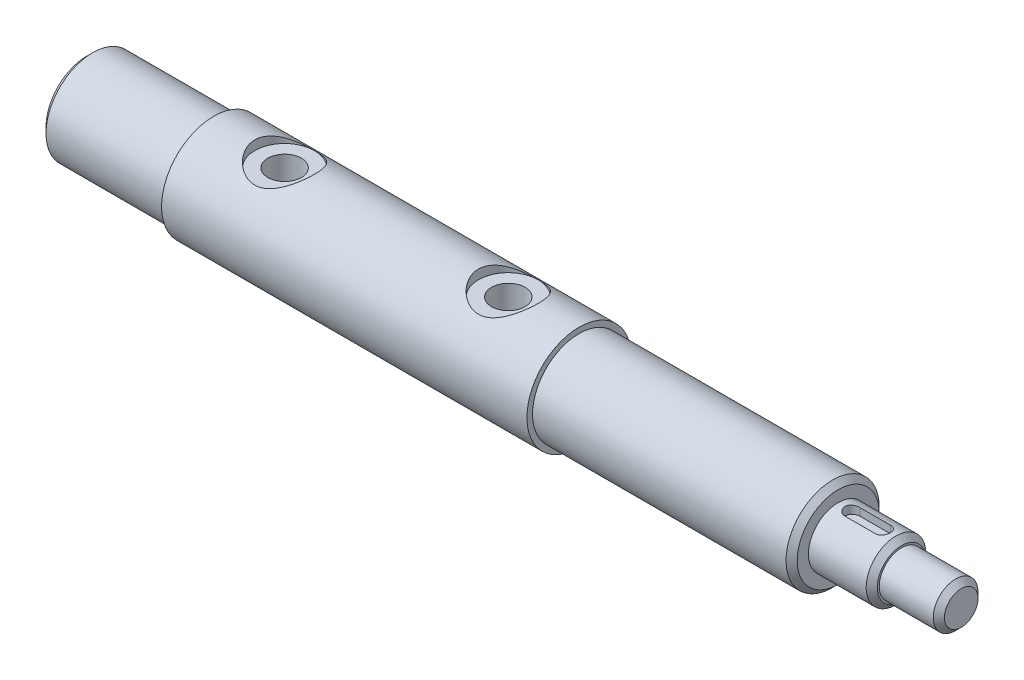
ISO-10303-21;
HEADER;
FILE_DESCRIPTION(('STEP AP214'),'2;1');
FILE_NAME('part.step','',(''),(''),'','','');
FILE_SCHEMA(('AUTOMOTIVE_DESIGN { 1 0 10303 214 1 1 1 1 }'));
ENDSEC;
DATA;
#1=APPLICATION_CONTEXT('core data for automotive mechanical design processes');
#2=APPLICATION_PROTOCOL_DEFINITION('international standard','automotive_design',2000,#1);
#3=PRODUCT_CONTEXT('',#1,'mechanical');
#4=PRODUCT('Part','Part','',(#3));
#5=PRODUCT_RELATED_PRODUCT_CATEGORY('part','',(#4));
#6=PRODUCT_DEFINITION_FORMATION('','',#4);
#7=PRODUCT_DEFINITION_CONTEXT('part definition',#1,'design');
#8=PRODUCT_DEFINITION('design','',#6,#7);
#9=PRODUCT_DEFINITION_SHAPE('','',#8);
#10=(LENGTH_UNIT() NAMED_UNIT(*) SI_UNIT(.MILLI.,.METRE.));
#11=(NAMED_UNIT(*) PLANE_ANGLE_UNIT() SI_UNIT($,.RADIAN.));
#12=(NAMED_UNIT(*) SI_UNIT($,.STERADIAN.) SOLID_ANGLE_UNIT());
#13=UNCERTAINTY_MEASURE_WITH_UNIT(LENGTH_MEASURE(1.E-05),#10,'distance_accuracy_value','');
#14=(GEOMETRIC_REPRESENTATION_CONTEXT(3) GLOBAL_UNCERTAINTY_ASSIGNED_CONTEXT((#13)) GLOBAL_UNIT_ASSIGNED_CONTEXT((#10,
#11,#12)) REPRESENTATION_CONTEXT('',''));
#15=CARTESIAN_POINT('',(0.,0.,0.));
#16=DIRECTION('',(0.,0.,1.));
#17=DIRECTION('',(1.,0.,0.));
#18=AXIS2_PLACEMENT_3D('',#15,#16,#17);
#19=CARTESIAN_POINT('',(134.5,6.,0.));
#20=DIRECTION('',(1.,0.,0.));
#21=DIRECTION('',(0.,1.,0.));
#22=AXIS2_PLACEMENT_3D('',#19,#20,#21);
#23=PLANE('',#22);
#24=CARTESIAN_POINT('',(134.5,0.,0.));
#25=DIRECTION('',(1.,0.,0.));
#26=DIRECTION('',(0.,1.,0.));
#27=AXIS2_PLACEMENT_3D('',#24,#25,#26);
#28=CIRCLE('',#27,4.49999999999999);
#29=CARTESIAN_POINT('',(134.5,4.49999999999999,0.));
#30=VERTEX_POINT('',#29);
#31=EDGE_CURVE('E226',#30,#30,#28,.T.);
#32=ORIENTED_EDGE('',*,*,#31,.T.);
#33=EDGE_LOOP('',(#32));
#34=FACE_BOUND('',#33,.T.);
#35=ADVANCED_FACE('F24',(#34),#23,.T.);
#36=CARTESIAN_POINT('',(-100.,0.,0.));
#37=DIRECTION('',(1.,0.,0.));
#38=DIRECTION('',(0.,1.,0.));
#39=AXIS2_PLACEMENT_3D('',#36,#37,#38);
#40=CYLINDRICAL_SURFACE('',#39,6.);
#41=CARTESIAN_POINT('',(133.,0.,0.));
#42=DIRECTION('',(1.,0.,0.));
#43=DIRECTION('',(0.,1.,0.));
#44=AXIS2_PLACEMENT_3D('',#41,#42,#43);
#45=CIRCLE('',#44,6.);
#46=CARTESIAN_POINT('',(133.,6.,0.));
#47=VERTEX_POINT('',#46);
#48=EDGE_CURVE('E228',#47,#47,#45,.F.);
#49=ORIENTED_EDGE('',*,*,#48,.T.);
#50=EDGE_LOOP('',(#49));
#51=FACE_BOUND('',#50,.T.);
#52=CARTESIAN_POINT('',(118.5,0.,0.));
#53=DIRECTION('',(1.,0.,0.));
#54=DIRECTION('',(0.,1.,0.));
#55=AXIS2_PLACEMENT_3D('',#52,#53,#54);
#56=CIRCLE('',#55,6.);
#57=CARTESIAN_POINT('',(118.5,6.,0.));
#58=VERTEX_POINT('',#57);
#59=EDGE_CURVE('E175',#58,#58,#56,.T.);
#60=ORIENTED_EDGE('',*,*,#59,.T.);
#61=EDGE_LOOP('',(#60));
#62=FACE_BOUND('',#61,.T.);
#63=ADVANCED_FACE('F217',(#51,#62),#40,.T.);
#64=CARTESIAN_POINT('',(118.5,8.,0.));
#65=DIRECTION('',(1.,0.,0.));
#66=DIRECTION('',(0.,1.,0.));
#67=AXIS2_PLACEMENT_3D('',#64,#65,#66);
#68=PLANE('',#67);
#69=CARTESIAN_POINT('',(118.5,0.,0.));
#70=DIRECTION('',(1.,0.,0.));
#71=DIRECTION('',(0.,1.,0.));
#72=AXIS2_PLACEMENT_3D('',#69,#70,#71);
#73=CIRCLE('',#72,6.49999999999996);
#74=CARTESIAN_POINT('',(118.5,6.49999999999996,0.));
#75=VERTEX_POINT('',#74);
#76=EDGE_CURVE('E235',#75,#75,#73,.T.);
#77=ORIENTED_EDGE('',*,*,#76,.T.);
#78=EDGE_LOOP('',(#77));
#79=FACE_BOUND('',#78,.T.);
#80=ORIENTED_EDGE('',*,*,#59,.F.);
#81=EDGE_LOOP('',(#80));
#82=FACE_BOUND('',#81,.T.);
#83=ADVANCED_FACE('F222',(#79,#82),#68,.T.);
#84=CARTESIAN_POINT('',(-100.,0.,0.));
#85=DIRECTION('',(1.,0.,0.));
#86=DIRECTION('',(0.,1.,0.));
#87=AXIS2_PLACEMENT_3D('',#84,#85,#86);
#88=CYLINDRICAL_SURFACE('',#87,8.);
#89=CARTESIAN_POINT('',(111.5,8.,0.));
#90=CARTESIAN_POINT('',(111.500003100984,7.99999813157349,0.110501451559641));
#91=CARTESIAN_POINT('',(111.509188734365,7.99768770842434,0.22103754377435));
#92=CARTESIAN_POINT('',(111.545633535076,7.98869485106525,0.438941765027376));
#93=CARTESIAN_POINT('',(111.57290294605,7.98200993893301,0.546308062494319));
#94=CARTESIAN_POINT('',(111.644585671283,7.96500835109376,0.754694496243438));
#95=CARTESIAN_POINT('',(111.688978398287,7.95469603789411,0.855722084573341));
#96=CARTESIAN_POINT('',(111.793575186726,7.93153791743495,1.04889617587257));
#97=CARTESIAN_POINT('',(111.853779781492,7.91869202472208,1.14104237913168));
#98=CARTESIAN_POINT('',(111.989601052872,7.89156551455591,1.31573590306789));
#99=CARTESIAN_POINT('',(112.065482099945,7.87726276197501,1.39807425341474));
#100=CARTESIAN_POINT('',(112.229936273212,7.84898160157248,1.54899856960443));
#101=CARTESIAN_POINT('',(112.318510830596,7.83500323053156,1.61758298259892));
#102=CARTESIAN_POINT('',(112.507460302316,7.80873034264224,1.74003539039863));
#103=CARTESIAN_POINT('',(112.607990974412,7.79646392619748,1.79366962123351));
#104=CARTESIAN_POINT('',(112.816997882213,7.77532659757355,1.88319587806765));
#105=CARTESIAN_POINT('',(112.925472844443,7.76645514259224,1.91909074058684));
#106=CARTESIAN_POINT('',(113.144991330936,7.7533396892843,1.97140644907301));
#107=CARTESIAN_POINT('',(113.255939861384,7.74900654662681,1.98820302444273));
#108=CARTESIAN_POINT('',(113.479158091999,7.74519149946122,2.00301570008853));
#109=CARTESIAN_POINT('',(113.591427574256,7.74570880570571,2.00103485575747));
#110=CARTESIAN_POINT('',(113.811221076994,7.75145607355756,1.97864869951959));
#111=CARTESIAN_POINT('',(113.918794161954,7.75657150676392,1.95869112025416));
#112=CARTESIAN_POINT('',(114.129014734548,7.77075612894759,1.90163224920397));
#113=CARTESIAN_POINT('',(114.231661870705,7.77982559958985,1.8645297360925));
#114=CARTESIAN_POINT('',(114.430317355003,7.80100151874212,1.77385263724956));
#115=CARTESIAN_POINT('',(114.526248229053,7.81313769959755,1.72011555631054));
#116=CARTESIAN_POINT('',(114.707891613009,7.83906281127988,1.59780836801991));
#117=CARTESIAN_POINT('',(114.793602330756,7.85285203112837,1.52923566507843));
#118=CARTESIAN_POINT('',(114.954938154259,7.88101174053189,1.3768845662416));
#119=CARTESIAN_POINT('',(115.030205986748,7.89538759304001,1.29272834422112));
#120=CARTESIAN_POINT('',(115.165628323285,7.92274620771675,1.1128158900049));
#121=CARTESIAN_POINT('',(115.225782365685,7.93572892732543,1.01705930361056));
#122=CARTESIAN_POINT('',(115.329400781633,7.9589030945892,0.816154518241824));
#123=CARTESIAN_POINT('',(115.372807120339,7.96908480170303,0.710975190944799));
#124=CARTESIAN_POINT('',(115.441223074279,7.98543889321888,0.494501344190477));
#125=CARTESIAN_POINT('',(115.466236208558,7.99161204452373,0.38320799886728));
#126=CARTESIAN_POINT('',(115.496610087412,7.999139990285,0.160719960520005));
#127=CARTESIAN_POINT('',(115.5024573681,8.00061404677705,0.0495956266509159));
#128=CARTESIAN_POINT('',(115.495667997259,7.998917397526,-0.172043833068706));
#129=CARTESIAN_POINT('',(115.483033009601,7.99574710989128,-0.282559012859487));
#130=CARTESIAN_POINT('',(115.440038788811,7.98519441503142,-0.498152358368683));
#131=CARTESIAN_POINT('',(115.409944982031,7.97787512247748,-0.603286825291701));
#132=CARTESIAN_POINT('',(115.333190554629,7.95984942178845,-0.807009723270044));
#133=CARTESIAN_POINT('',(115.286528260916,7.94914267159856,-0.90559749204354));
#134=CARTESIAN_POINT('',(115.177018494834,7.92524410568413,-1.09536417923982));
#135=CARTESIAN_POINT('',(115.113898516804,7.91201156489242,-1.18638058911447));
#136=CARTESIAN_POINT('',(114.973613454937,7.88459345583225,-1.35670215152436));
#137=CARTESIAN_POINT('',(114.896445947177,7.87040772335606,-1.4360052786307));
#138=CARTESIAN_POINT('',(114.727997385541,7.84225275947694,-1.58265409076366));
#139=CARTESIAN_POINT('',(114.636416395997,7.82829738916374,-1.64965849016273));
#140=CARTESIAN_POINT('',(114.443023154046,7.80257171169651,-1.76734767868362));
#141=CARTESIAN_POINT('',(114.341211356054,7.79080130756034,-1.8180331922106));
#142=CARTESIAN_POINT('',(114.130792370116,7.77090792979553,-1.90126856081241));
#143=CARTESIAN_POINT('',(114.022229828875,7.76276340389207,-1.93392586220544));
#144=CARTESIAN_POINT('',(113.800920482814,7.75102325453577,-1.98046087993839));
#145=CARTESIAN_POINT('',(113.688174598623,7.74742663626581,-1.99434270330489));
#146=CARTESIAN_POINT('',(113.465171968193,7.74526534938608,-2.00271812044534));
#147=CARTESIAN_POINT('',(113.354936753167,7.74655910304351,-1.99775719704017));
#148=CARTESIAN_POINT('',(113.136928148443,7.7537054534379,-1.96983637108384));
#149=CARTESIAN_POINT('',(113.029154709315,7.75955795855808,-1.94687683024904));
#150=CARTESIAN_POINT('',(112.819722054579,7.77508347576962,-1.88390842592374));
#151=CARTESIAN_POINT('',(112.71803025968,7.78473353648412,-1.84400187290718));
#152=CARTESIAN_POINT('',(112.522712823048,7.80677007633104,-1.74835321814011));
#153=CARTESIAN_POINT('',(112.429088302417,7.81915693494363,-1.6926089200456));
#154=CARTESIAN_POINT('',(112.249927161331,7.84567512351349,-1.56515699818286));
#155=CARTESIAN_POINT('',(112.164665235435,7.85984353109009,-1.49307088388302));
#156=CARTESIAN_POINT('',(112.007270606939,7.88810702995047,-1.33571916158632));
#157=CARTESIAN_POINT('',(111.935141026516,7.90220210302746,-1.2504504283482));
#158=CARTESIAN_POINT('',(111.804784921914,7.9290354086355,-1.06729011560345));
#159=CARTESIAN_POINT('',(111.746833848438,7.94174444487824,-0.969197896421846));
#160=CARTESIAN_POINT('',(111.648336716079,7.96406566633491,-0.764354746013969));
#161=CARTESIAN_POINT('',(111.607778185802,7.97368006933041,-0.657610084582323));
#162=CARTESIAN_POINT('',(111.55123755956,7.98730746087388,-0.4592136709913));
#163=CARTESIAN_POINT('',(111.532065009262,7.9920344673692,-0.368506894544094));
#164=CARTESIAN_POINT('',(111.506445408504,7.99838140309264,-0.185208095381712));
#165=CARTESIAN_POINT('',(111.499997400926,8.00000156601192,-0.0926162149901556));
#166=CARTESIAN_POINT('',(111.5,8.,0.));
#167=B_SPLINE_CURVE_WITH_KNOTS('',3,(#89,#90,#91,#92,#93,#94,#95,#96,#97,#98,#99,#100,#101,#102,
#103,#104,#105,#106,#107,#108,#109,#110,#111,#112,#113,#114,#115,#116,#117,#118,#119,#120,#121,
#122,#123,#124,#125,#126,#127,#128,#129,#130,#131,#132,#133,#134,#135,#136,#137,#138,#139,#140,
#141,#142,#143,#144,#145,#146,#147,#148,#149,#150,#151,#152,#153,#154,#155,#156,#157,#158,#159,
#160,#161,#162,#163,#164,#165,#166),.UNSPECIFIED.,.T.,.F.,(4,2,2,2,2,2,2,2,2,2,2,2,2,2,2,2,2,2,
2,2,2,2,2,2,2,2,2,2,2,2,2,2,2,2,2,2,2,2,4),(0.,0.331164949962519,0.662517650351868,
0.993473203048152,1.32443992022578,1.66152580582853,1.99864972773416,2.34078196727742,
2.68285948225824,3.01808393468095,3.35325384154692,3.68029996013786,4.00736937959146,
4.337740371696,4.66816921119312,5.00802001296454,5.34788119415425,5.68890972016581,
6.02987298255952,6.36211078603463,6.69431868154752,7.02160366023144,7.34892169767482,
7.68204783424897,8.01523150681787,8.35659345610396,8.69794025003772,9.03723006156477,
9.37644564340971,9.70591707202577,10.0353818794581,10.3628853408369,10.6904342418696,
11.0265276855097,11.3627009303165,11.7049624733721,12.0469781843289,12.3245632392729,
12.6021274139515),.UNSPECIFIED.);
#168=CARTESIAN_POINT('',(113.5,7.74596669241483,1.99999999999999));
#169=VERTEX_POINT('',#168);
#170=CARTESIAN_POINT('',(113.5,7.74596669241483,-2.00000000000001));
#171=VERTEX_POINT('',#170);
#172=EDGE_CURVE('E232',#169,#171,#167,.T.);
#173=ORIENTED_EDGE('',*,*,#172,.F.);
#174=DIRECTION('',(1.,0.,0.));
#175=VECTOR('',#174,1.);
#176=CARTESIAN_POINT('',(-100.,7.74596669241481,1.99999999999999));
#177=LINE('',#176,#175);
#178=CARTESIAN_POINT('',(105.3,7.74596669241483,1.99999999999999));
#179=VERTEX_POINT('',#178);
#180=EDGE_CURVE('E11',#179,#169,#177,.T.);
#181=ORIENTED_EDGE('',*,*,#180,.F.);
#182=CARTESIAN_POINT('',(105.3,7.74596669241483,-2.00000000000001));
#183=CARTESIAN_POINT('',(105.244674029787,7.74596297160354,-2.00000067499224));
#184=CARTESIAN_POINT('',(105.189375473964,7.74656019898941,-1.99770281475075));
#185=CARTESIAN_POINT('',(105.079191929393,7.74891809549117,-1.98854259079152));
#186=CARTESIAN_POINT('',(105.024306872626,7.75067856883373,-1.98168099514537));
#187=CARTESIAN_POINT('',(104.861093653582,7.75763421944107,-1.95435047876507));
#188=CARTESIAN_POINT('',(104.753887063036,7.76450406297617,-1.927135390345));
#189=CARTESIAN_POINT('',(104.545750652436,7.78190845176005,-1.85559615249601));
#190=CARTESIAN_POINT('',(104.444820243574,7.79244265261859,-1.81127361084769));
#191=CARTESIAN_POINT('',(104.251777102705,7.81598268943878,-1.70683075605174));
#192=CARTESIAN_POINT('',(104.159666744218,7.82898918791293,-1.64670620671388));
#193=CARTESIAN_POINT('',(103.984912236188,7.85632524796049,-1.51096894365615));
#194=CARTESIAN_POINT('',(103.902490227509,7.87067582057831,-1.43507453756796));
#195=CARTESIAN_POINT('',(103.751395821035,7.89890208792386,-1.27055156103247));
#196=CARTESIAN_POINT('',(103.682725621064,7.91277770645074,-1.18192095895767));
#197=CARTESIAN_POINT('',(103.560177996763,7.93872364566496,-0.992913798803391));
#198=CARTESIAN_POINT('',(103.506520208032,7.9507660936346,-0.892390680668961));
#199=CARTESIAN_POINT('',(103.416950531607,7.97144692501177,-0.683405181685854));
#200=CARTESIAN_POINT('',(103.3810351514,7.98008597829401,-0.574944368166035));
#201=CARTESIAN_POINT('',(103.328682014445,7.99283800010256,-0.355488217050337));
#202=CARTESIAN_POINT('',(103.311864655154,7.99703905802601,-0.244588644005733));
#203=CARTESIAN_POINT('',(103.296993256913,8.00074876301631,-0.0214655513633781));
#204=CARTESIAN_POINT('',(103.298936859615,8.00025799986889,0.0907578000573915));
#205=CARTESIAN_POINT('',(103.321259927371,7.99470474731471,0.310704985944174));
#206=CARTESIAN_POINT('',(103.341229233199,7.98974397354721,0.418473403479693));
#207=CARTESIAN_POINT('',(103.398377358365,7.97592661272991,0.629077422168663));
#208=CARTESIAN_POINT('',(103.435556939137,7.96706985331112,0.731912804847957));
#209=CARTESIAN_POINT('',(103.526402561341,7.94629995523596,0.930814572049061));
#210=CARTESIAN_POINT('',(103.580214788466,7.93435987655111,1.02681125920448));
#211=CARTESIAN_POINT('',(103.702686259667,7.90871891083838,1.20855326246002));
#212=CARTESIAN_POINT('',(103.771347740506,7.89501775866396,1.29429703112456));
#213=CARTESIAN_POINT('',(103.923757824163,7.86691132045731,1.45553877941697));
#214=CARTESIAN_POINT('',(104.00786327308,7.8524970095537,1.53069820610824));
#215=CARTESIAN_POINT('',(104.187659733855,7.82492336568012,1.66593915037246));
#216=CARTESIAN_POINT('',(104.283353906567,7.81176437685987,1.72601654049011));
#217=CARTESIAN_POINT('',(104.484291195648,7.78815627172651,1.8296094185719));
#218=CARTESIAN_POINT('',(104.589582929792,7.77772212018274,1.87303403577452));
#219=CARTESIAN_POINT('',(104.806233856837,7.7609411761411,1.94140470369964));
#220=CARTESIAN_POINT('',(104.9175837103,7.75458827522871,1.96637837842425));
#221=CARTESIAN_POINT('',(105.074914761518,7.74910581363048,1.98780927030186));
#222=CARTESIAN_POINT('',(105.119839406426,7.74793046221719,1.9923815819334));
#223=CARTESIAN_POINT('',(105.209835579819,7.74636124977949,1.99847351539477));
#224=CARTESIAN_POINT('',(105.254906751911,7.74596612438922,1.99999807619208));
#225=CARTESIAN_POINT('',(105.3,7.74596669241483,1.99999999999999));
#226=B_SPLINE_CURVE_WITH_KNOTS('',3,(#182,#183,#184,#185,#186,#187,#188,#189,#190,#191,#192,
#193,#194,#195,#196,#197,#198,#199,#200,#201,#202,#203,#204,#205,#206,#207,#208,#209,#210,#211,
#212,#213,#214,#215,#216,#217,#218,#219,#220,#221,#222,#223,#224,#225),.UNSPECIFIED.,.F.,.F.,(4,
2,2,2,2,2,2,2,2,2,2,2,2,2,2,2,2,2,2,2,2,4),(0.,0.165873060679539,0.331718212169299,
0.662459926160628,0.993170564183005,1.3239699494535,1.66128379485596,1.99865150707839,
2.3407237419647,2.68272861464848,3.01780963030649,3.35284852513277,3.68045090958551,
4.00806778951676,4.33865018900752,4.66928241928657,5.00882859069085,5.34846758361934,
5.68993440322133,6.03088895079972,6.16631697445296,6.30152535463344),.UNSPECIFIED.);
#227=CARTESIAN_POINT('',(105.3,7.74596669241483,-2.00000000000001));
#228=VERTEX_POINT('',#227);
#229=EDGE_CURVE('E31',#228,#179,#226,.T.);
#230=ORIENTED_EDGE('',*,*,#229,.F.);
#231=DIRECTION('',(1.,0.,0.));
#232=VECTOR('',#231,1.);
#233=CARTESIAN_POINT('',(-100.,7.7459666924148,-2.));
#234=LINE('',#233,#232);
#235=EDGE_CURVE('E244',#171,#228,#234,.F.);
#236=ORIENTED_EDGE('',*,*,#235,.F.);
#237=EDGE_LOOP('',(#173,#181,#230,#236));
#238=FACE_BOUND('',#237,.T.);
#239=CARTESIAN_POINT('',(117.,0.,0.));
#240=DIRECTION('',(1.,0.,0.));
#241=DIRECTION('',(0.,1.,0.));
#242=AXIS2_PLACEMENT_3D('',#239,#240,#241);
#243=CIRCLE('',#242,8.);
#244=CARTESIAN_POINT('',(117.,8.,0.));
#245=VERTEX_POINT('',#244);
#246=EDGE_CURVE('E229',#245,#245,#243,.F.);
#247=ORIENTED_EDGE('',*,*,#246,.T.);
#248=EDGE_LOOP('',(#247));
#249=FACE_BOUND('',#248,.T.);
#250=CARTESIAN_POINT('',(101.5,0.,0.));
#251=DIRECTION('',(1.,0.,0.));
#252=DIRECTION('',(0.,1.,0.));
#253=AXIS2_PLACEMENT_3D('',#250,#251,#252);
#254=CIRCLE('',#253,8.);
#255=CARTESIAN_POINT('',(101.5,8.,0.));
#256=VERTEX_POINT('',#255);
#257=EDGE_CURVE('E172',#256,#256,#254,.T.);
#258=ORIENTED_EDGE('',*,*,#257,.T.);
#259=EDGE_LOOP('',(#258));
#260=FACE_BOUND('',#259,.T.);
#261=ADVANCED_FACE('F245',(#238,#249,#260),#88,.T.);
#262=CARTESIAN_POINT('',(101.5,12.5,0.));
#263=DIRECTION('',(1.,0.,0.));
#264=DIRECTION('',(0.,1.,0.));
#265=AXIS2_PLACEMENT_3D('',#262,#263,#264);
#266=PLANE('',#265);
#267=CARTESIAN_POINT('',(101.5,0.,0.));
#268=DIRECTION('',(1.,0.,0.));
#269=DIRECTION('',(0.,1.,0.));
#270=AXIS2_PLACEMENT_3D('',#267,#268,#269);
#271=CIRCLE('',#270,11.);
#272=CARTESIAN_POINT('',(101.5,11.,0.));
#273=VERTEX_POINT('',#272);
#274=EDGE_CURVE('E431',#273,#273,#271,.T.);
#275=ORIENTED_EDGE('',*,*,#274,.T.);
#276=EDGE_LOOP('',(#275));
#277=FACE_BOUND('',#276,.T.);
#278=ORIENTED_EDGE('',*,*,#257,.F.);
#279=EDGE_LOOP('',(#278));
#280=FACE_BOUND('',#279,.T.);
#281=ADVANCED_FACE('F273',(#277,#280),#266,.T.);
#282=CARTESIAN_POINT('',(-100.,0.,0.));
#283=DIRECTION('',(1.,0.,0.));
#284=DIRECTION('',(0.,1.,0.));
#285=AXIS2_PLACEMENT_3D('',#282,#283,#284);
#286=CYLINDRICAL_SURFACE('',#285,12.5);
#287=CARTESIAN_POINT('',(99.9999999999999,0.,0.));
#288=DIRECTION('',(1.,0.,0.));
#289=DIRECTION('',(0.,1.,0.));
#290=AXIS2_PLACEMENT_3D('',#287,#288,#289);
#291=CIRCLE('',#290,12.5);
#292=CARTESIAN_POINT('',(99.9999999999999,12.5,0.));
#293=VERTEX_POINT('',#292);
#294=EDGE_CURVE('E429',#293,#293,#291,.F.);
#295=ORIENTED_EDGE('',*,*,#294,.T.);
#296=EDGE_LOOP('',(#295));
#297=FACE_BOUND('',#296,.T.);
#298=CARTESIAN_POINT('',(32.,0.,0.));
#299=DIRECTION('',(1.,0.,0.));
#300=DIRECTION('',(0.,1.,0.));
#301=AXIS2_PLACEMENT_3D('',#298,#299,#300);
#302=CIRCLE('',#301,12.5);
#303=CARTESIAN_POINT('',(32.,12.5,0.));
#304=VERTEX_POINT('',#303);
#305=EDGE_CURVE('E169',#304,#304,#302,.T.);
#306=ORIENTED_EDGE('',*,*,#305,.T.);
#307=EDGE_LOOP('',(#306));
#308=FACE_BOUND('',#307,.T.);
#309=ADVANCED_FACE('F279',(#297,#308),#286,.T.);
#310=CARTESIAN_POINT('',(32.,12.5,0.));
#311=DIRECTION('',(1.,0.,0.));
#312=DIRECTION('',(0.,1.,0.));
#313=AXIS2_PLACEMENT_3D('',#310,#311,#312);
#314=PLANE('',#313);
#315=CARTESIAN_POINT('',(32.,0.,0.));
#316=DIRECTION('',(1.,0.,0.));
#317=DIRECTION('',(0.,1.,0.));
#318=AXIS2_PLACEMENT_3D('',#315,#316,#317);
#319=CIRCLE('',#318,14.);
#320=CARTESIAN_POINT('',(32.,14.,0.));
#321=VERTEX_POINT('',#320);
#322=EDGE_CURVE('E166',#321,#321,#319,.T.);
#323=ORIENTED_EDGE('',*,*,#322,.T.);
#324=EDGE_LOOP('',(#323));
#325=FACE_BOUND('',#324,.T.);
#326=ORIENTED_EDGE('',*,*,#305,.F.);
#327=EDGE_LOOP('',(#326));
#328=FACE_BOUND('',#327,.T.);
#329=ADVANCED_FACE('F213',(#325,#328),#314,.T.);
#330=CARTESIAN_POINT('',(-100.,0.,0.));
#331=DIRECTION('',(1.,0.,0.));
#332=DIRECTION('',(0.,1.,0.));
#333=AXIS2_PLACEMENT_3D('',#330,#331,#332);
#334=CYLINDRICAL_SURFACE('',#333,14.);
#335=CARTESIAN_POINT('',(-42.5,-14.,0.));
#336=CARTESIAN_POINT('',(-42.500000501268,-13.9999995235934,0.246024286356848));
#337=CARTESIAN_POINT('',(-42.5202421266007,-13.993454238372,0.492055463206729));
#338=CARTESIAN_POINT('',(-42.6004466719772,-13.9679864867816,0.976900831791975));
#339=CARTESIAN_POINT('',(-42.6604165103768,-13.9490618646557,1.21571375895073));
#340=CARTESIAN_POINT('',(-42.8178304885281,-13.9008981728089,1.67906185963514));
#341=CARTESIAN_POINT('',(-42.9152146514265,-13.8716756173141,1.90361921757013));
#342=CARTESIAN_POINT('',(-43.1444309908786,-13.8059187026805,2.33321600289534));
#343=CARTESIAN_POINT('',(-43.2762691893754,-13.7693830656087,2.53825200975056));
#344=CARTESIAN_POINT('',(-43.5751537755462,-13.6915371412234,2.929644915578));
#345=CARTESIAN_POINT('',(-43.7431177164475,-13.6501184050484,3.115279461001));
#346=CARTESIAN_POINT('',(-44.1075335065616,-13.5677891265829,3.45628881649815));
#347=CARTESIAN_POINT('',(-44.3039910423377,-13.5268786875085,3.61165757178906));
#348=CARTESIAN_POINT('',(-44.7261756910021,-13.4490220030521,3.89172829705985));
#349=CARTESIAN_POINT('',(-44.9525385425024,-13.4122089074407,4.01551249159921));
#350=CARTESIAN_POINT('',(-45.4242433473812,-13.3483536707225,4.22295159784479));
#351=CARTESIAN_POINT('',(-45.6695799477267,-13.3213087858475,4.30661778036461));
#352=CARTESIAN_POINT('',(-46.1640893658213,-13.2811896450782,4.42877453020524));
#353=CARTESIAN_POINT('',(-46.4128951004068,-13.2677003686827,4.46861090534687));
#354=CARTESIAN_POINT('',(-46.9139963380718,-13.2549894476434,4.50618295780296));
#355=CARTESIAN_POINT('',(-47.1662908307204,-13.2557637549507,4.50393058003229));
#356=CARTESIAN_POINT('',(-47.6559320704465,-13.2711272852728,4.45843841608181));
#357=CARTESIAN_POINT('',(-47.893460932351,-13.2851334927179,4.41692829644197));
#358=CARTESIAN_POINT('',(-48.3579854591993,-13.324432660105,4.29691064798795));
#359=CARTESIAN_POINT('',(-48.5849799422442,-13.3497268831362,4.21839897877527));
#360=CARTESIAN_POINT('',(-49.0260319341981,-13.4091855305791,4.02542337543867));
#361=CARTESIAN_POINT('',(-49.2398392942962,-13.4434793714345,3.91042931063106));
#362=CARTESIAN_POINT('',(-49.6456815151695,-13.5170160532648,3.64812124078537));
#363=CARTESIAN_POINT('',(-49.837710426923,-13.5562602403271,3.50079843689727));
#364=CARTESIAN_POINT('',(-50.2042987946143,-13.6375956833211,3.16960326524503));
#365=CARTESIAN_POINT('',(-50.3775656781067,-13.6797328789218,2.98430873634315));
#366=CARTESIAN_POINT('',(-50.6908906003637,-13.760439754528,2.58677067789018));
#367=CARTESIAN_POINT('',(-50.8309458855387,-13.799009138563,2.37452491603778));
#368=CARTESIAN_POINT('',(-51.0748163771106,-13.8686809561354,1.92651302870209));
#369=CARTESIAN_POINT('',(-51.1783073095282,-13.899715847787,1.69055916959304));
#370=CARTESIAN_POINT('',(-51.3437369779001,-13.9503333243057,1.20335879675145));
#371=CARTESIAN_POINT('',(-51.4056890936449,-13.9699195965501,0.95211723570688));
#372=CARTESIAN_POINT('',(-51.4840436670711,-13.9948322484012,0.452432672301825));
#373=CARTESIAN_POINT('',(-51.5021945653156,-14.0007056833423,0.204290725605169));
#374=CARTESIAN_POINT('',(-51.4973826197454,-13.9991584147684,-0.291528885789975));
#375=CARTESIAN_POINT('',(-51.4744261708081,-13.9917397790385,-0.539206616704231));
#376=CARTESIAN_POINT('',(-51.3894466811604,-13.964802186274,-1.0202162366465));
#377=CARTESIAN_POINT('',(-51.3284778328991,-13.9456099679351,-1.25375444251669));
#378=CARTESIAN_POINT('',(-51.1705038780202,-13.8973907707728,-1.70720990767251));
#379=CARTESIAN_POINT('',(-51.0734942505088,-13.8683625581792,-1.92712545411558));
#380=CARTESIAN_POINT('',(-50.843465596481,-13.8025291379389,-2.35326980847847));
#381=CARTESIAN_POINT('',(-50.7095998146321,-13.7655461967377,-2.55901332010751));
#382=CARTESIAN_POINT('',(-50.4106655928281,-13.6880178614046,-2.9456956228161));
#383=CARTESIAN_POINT('',(-50.2455882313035,-13.6474714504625,-3.12662729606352));
#384=CARTESIAN_POINT('',(-49.8806912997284,-13.5652324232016,-3.46646023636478));
#385=CARTESIAN_POINT('',(-49.679702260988,-13.5235633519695,-3.62411439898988));
#386=CARTESIAN_POINT('',(-49.2532190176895,-13.4455618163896,-3.90358695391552));
#387=CARTESIAN_POINT('',(-49.0277249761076,-13.4092293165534,-4.02540558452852));
#388=CARTESIAN_POINT('',(-48.5588798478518,-13.3464006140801,-4.22906391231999));
#389=CARTESIAN_POINT('',(-48.3155881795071,-13.3198733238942,-4.31103022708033));
#390=CARTESIAN_POINT('',(-47.8176187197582,-13.279949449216,-4.43250614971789));
#391=CARTESIAN_POINT('',(-47.5629456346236,-13.266547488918,-4.47203314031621));
#392=CARTESIAN_POINT('',(-47.0625413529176,-13.2549737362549,-4.50621360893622));
#393=CARTESIAN_POINT('',(-46.8169650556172,-13.2561041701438,-4.5029228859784));
#394=CARTESIAN_POINT('',(-46.3300531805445,-13.2717600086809,-4.4565649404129));
#395=CARTESIAN_POINT('',(-46.0887173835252,-13.2862847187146,-4.41349978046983));
#396=CARTESIAN_POINT('',(-45.6210478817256,-13.3265911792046,-4.29022584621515));
#397=CARTESIAN_POINT('',(-45.3945330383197,-13.3521843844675,-4.210637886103));
#398=CARTESIAN_POINT('',(-44.9578934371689,-13.4116866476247,-4.01707184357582));
#399=CARTESIAN_POINT('',(-44.7477721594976,-13.4455974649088,-3.90308648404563));
#400=CARTESIAN_POINT('',(-44.3405407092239,-13.5196505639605,-3.63849325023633));
#401=CARTESIAN_POINT('',(-44.1443189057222,-13.5599915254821,-3.48657392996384));
#402=CARTESIAN_POINT('',(-43.7794885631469,-13.6414811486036,-3.15269442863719));
#403=CARTESIAN_POINT('',(-43.6108876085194,-13.6826300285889,-2.97072602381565));
#404=CARTESIAN_POINT('',(-43.3001152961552,-13.7628404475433,-2.57419911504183));
#405=CARTESIAN_POINT('',(-43.1590856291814,-13.8017772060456,-2.35871763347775));
#406=CARTESIAN_POINT('',(-42.9154252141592,-13.8715561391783,-1.90585991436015));
#407=CARTESIAN_POINT('',(-42.8127815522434,-13.9024010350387,-1.66849107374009));
#408=CARTESIAN_POINT('',(-42.6549509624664,-13.9507776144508,-1.19519822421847));
#409=CARTESIAN_POINT('',(-42.5970194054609,-13.9690698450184,-0.960266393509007));
#410=CARTESIAN_POINT('',(-42.519548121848,-13.9936798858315,-0.483557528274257));
#411=CARTESIAN_POINT('',(-42.4999995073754,-14.000000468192,-0.241782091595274));
#412=CARTESIAN_POINT('',(-42.5,-14.,0.));
#413=B_SPLINE_CURVE_WITH_KNOTS('',3,(#335,#336,#337,#338,#339,#340,#341,#342,#343,#344,#345,
#346,#347,#348,#349,#350,#351,#352,#353,#354,#355,#356,#357,#358,#359,#360,#361,#362,#363,#364,
#365,#366,#367,#368,#369,#370,#371,#372,#373,#374,#375,#376,#377,#378,#379,#380,#381,#382,#383,
#384,#385,#386,#387,#388,#389,#390,#391,#392,#393,#394,#395,#396,#397,#398,#399,#400,#401,#402,
#403,#404,#405,#406,#407,#408,#409,#410,#411,#412),.UNSPECIFIED.,.T.,.F.,(4,2,2,2,2,2,2,2,2,2,2,
2,2,2,2,2,2,2,2,2,2,2,2,2,2,2,2,2,2,2,2,2,2,2,2,2,2,2,4),(0.,0.737183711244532,1.47449583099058,
2.21063090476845,2.94689472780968,3.70470791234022,4.46267254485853,5.24064523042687,
6.01839922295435,6.77154100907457,7.52446905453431,8.24569691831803,8.96700550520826,
9.69931657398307,10.4318272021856,11.1997346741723,11.967705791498,12.7423261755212,
13.5166969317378,14.2596044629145,15.0023964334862,15.7254526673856,16.4485996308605,
17.1899913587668,17.9315953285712,18.7043997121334,19.4771989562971,20.2475265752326,
21.0175385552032,21.750722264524,22.4838679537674,23.2049886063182,23.9262619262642,
24.6771479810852,25.428239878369,26.2058185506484,26.9831353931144,27.7077756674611,
28.4322481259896),.UNSPECIFIED.);
#414=CARTESIAN_POINT('',(-42.5,-14.,0.));
#415=VERTEX_POINT('',#414);
#416=EDGE_CURVE('E122',#415,#415,#413,.T.);
#417=ORIENTED_EDGE('',*,*,#416,.F.);
#418=EDGE_LOOP('',(#417));
#419=FACE_BOUND('',#418,.T.);
#420=CARTESIAN_POINT('',(17.5,-14.,0.));
#421=CARTESIAN_POINT('',(17.499999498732,-13.9999995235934,0.246024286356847));
#422=CARTESIAN_POINT('',(17.4797578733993,-13.993454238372,0.492055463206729));
#423=CARTESIAN_POINT('',(17.3995533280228,-13.9679864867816,0.976900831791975));
#424=CARTESIAN_POINT('',(17.3395834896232,-13.9490618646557,1.21571375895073));
#425=CARTESIAN_POINT('',(17.1821695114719,-13.9008981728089,1.67906185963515));
#426=CARTESIAN_POINT('',(17.0847853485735,-13.8716756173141,1.90361921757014));
#427=CARTESIAN_POINT('',(16.8555690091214,-13.8059187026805,2.33321600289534));
#428=CARTESIAN_POINT('',(16.7237308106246,-13.7693830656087,2.53825200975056));
#429=CARTESIAN_POINT('',(16.4248462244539,-13.6915371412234,2.929644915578));
#430=CARTESIAN_POINT('',(16.2568822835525,-13.6501184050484,3.115279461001));
#431=CARTESIAN_POINT('',(15.8924664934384,-13.5677891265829,3.45628881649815));
#432=CARTESIAN_POINT('',(15.6960089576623,-13.5268786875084,3.61165757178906));
#433=CARTESIAN_POINT('',(15.2738243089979,-13.449022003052,3.89172829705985));
#434=CARTESIAN_POINT('',(15.0474614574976,-13.4122089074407,4.01551249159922));
#435=CARTESIAN_POINT('',(14.5757566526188,-13.3483536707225,4.2229515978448));
#436=CARTESIAN_POINT('',(14.3304200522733,-13.3213087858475,4.30661778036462));
#437=CARTESIAN_POINT('',(13.8359106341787,-13.2811896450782,4.42877453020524));
#438=CARTESIAN_POINT('',(13.5871048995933,-13.2677003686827,4.46861090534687));
#439=CARTESIAN_POINT('',(13.0860036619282,-13.2549894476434,4.50618295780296));
#440=CARTESIAN_POINT('',(12.8337091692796,-13.2557637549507,4.50393058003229));
#441=CARTESIAN_POINT('',(12.3440679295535,-13.2711272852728,4.45843841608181));
#442=CARTESIAN_POINT('',(12.106539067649,-13.2851334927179,4.41692829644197));
#443=CARTESIAN_POINT('',(11.6420145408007,-13.324432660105,4.29691064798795));
#444=CARTESIAN_POINT('',(11.4150200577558,-13.3497268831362,4.21839897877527));
#445=CARTESIAN_POINT('',(10.9739680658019,-13.4091855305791,4.02542337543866));
#446=CARTESIAN_POINT('',(10.7601607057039,-13.4434793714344,3.91042931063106));
#447=CARTESIAN_POINT('',(10.3543184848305,-13.5170160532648,3.64812124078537));
#448=CARTESIAN_POINT('',(10.162289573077,-13.5562602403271,3.50079843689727));
#449=CARTESIAN_POINT('',(9.79570120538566,-13.6375956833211,3.16960326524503));
#450=CARTESIAN_POINT('',(9.62243432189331,-13.6797328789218,2.98430873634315));
#451=CARTESIAN_POINT('',(9.30910939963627,-13.760439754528,2.58677067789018));
#452=CARTESIAN_POINT('',(9.16905411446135,-13.799009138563,2.37452491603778));
#453=CARTESIAN_POINT('',(8.92518362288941,-13.8686809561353,1.92651302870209));
#454=CARTESIAN_POINT('',(8.82169269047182,-13.899715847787,1.69055916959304));
#455=CARTESIAN_POINT('',(8.65626302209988,-13.9503333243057,1.20335879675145));
#456=CARTESIAN_POINT('',(8.59431090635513,-13.9699195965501,0.95211723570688));
#457=CARTESIAN_POINT('',(8.51595633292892,-13.9948322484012,0.452432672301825));
#458=CARTESIAN_POINT('',(8.49780543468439,-14.0007056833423,0.204290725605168));
#459=CARTESIAN_POINT('',(8.50261738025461,-13.9991584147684,-0.291528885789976));
#460=CARTESIAN_POINT('',(8.52557382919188,-13.9917397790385,-0.539206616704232));
#461=CARTESIAN_POINT('',(8.6105533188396,-13.964802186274,-1.0202162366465));
#462=CARTESIAN_POINT('',(8.67152216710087,-13.9456099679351,-1.25375444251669));
#463=CARTESIAN_POINT('',(8.82949612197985,-13.8973907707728,-1.70720990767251));
#464=CARTESIAN_POINT('',(8.92650574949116,-13.8683625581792,-1.92712545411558));
#465=CARTESIAN_POINT('',(9.15653440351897,-13.8025291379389,-2.35326980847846));
#466=CARTESIAN_POINT('',(9.29040018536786,-13.7655461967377,-2.55901332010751));
#467=CARTESIAN_POINT('',(9.58933440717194,-13.6880178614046,-2.9456956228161));
#468=CARTESIAN_POINT('',(9.75441176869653,-13.6474714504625,-3.12662729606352));
#469=CARTESIAN_POINT('',(10.1193087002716,-13.5652324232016,-3.46646023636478));
#470=CARTESIAN_POINT('',(10.320297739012,-13.5235633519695,-3.62411439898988));
#471=CARTESIAN_POINT('',(10.7467809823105,-13.4455618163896,-3.90358695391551));
#472=CARTESIAN_POINT('',(10.9722750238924,-13.4092293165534,-4.02540558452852));
#473=CARTESIAN_POINT('',(11.4411201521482,-13.3464006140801,-4.22906391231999));
#474=CARTESIAN_POINT('',(11.6844118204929,-13.3198733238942,-4.31103022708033));
#475=CARTESIAN_POINT('',(12.1823812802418,-13.279949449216,-4.43250614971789));
#476=CARTESIAN_POINT('',(12.4370543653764,-13.266547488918,-4.47203314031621));
#477=CARTESIAN_POINT('',(12.9374586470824,-13.2549737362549,-4.50621360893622));
#478=CARTESIAN_POINT('',(13.1830349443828,-13.2561041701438,-4.5029228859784));
#479=CARTESIAN_POINT('',(13.6699468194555,-13.2717600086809,-4.4565649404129));
#480=CARTESIAN_POINT('',(13.9112826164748,-13.2862847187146,-4.41349978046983));
#481=CARTESIAN_POINT('',(14.3789521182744,-13.3265911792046,-4.29022584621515));
#482=CARTESIAN_POINT('',(14.6054669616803,-13.3521843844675,-4.210637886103));
#483=CARTESIAN_POINT('',(15.0421065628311,-13.4116866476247,-4.01707184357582));
#484=CARTESIAN_POINT('',(15.2522278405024,-13.4455974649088,-3.90308648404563));
#485=CARTESIAN_POINT('',(15.6594592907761,-13.5196505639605,-3.63849325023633));
#486=CARTESIAN_POINT('',(15.8556810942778,-13.5599915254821,-3.48657392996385));
#487=CARTESIAN_POINT('',(16.2205114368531,-13.6414811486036,-3.1526944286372));
#488=CARTESIAN_POINT('',(16.3891123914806,-13.6826300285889,-2.97072602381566));
#489=CARTESIAN_POINT('',(16.6998847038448,-13.7628404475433,-2.57419911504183));
#490=CARTESIAN_POINT('',(16.8409143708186,-13.8017772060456,-2.35871763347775));
#491=CARTESIAN_POINT('',(17.0845747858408,-13.8715561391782,-1.90585991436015));
#492=CARTESIAN_POINT('',(17.1872184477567,-13.9024010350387,-1.66849107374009));
#493=CARTESIAN_POINT('',(17.3450490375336,-13.9507776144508,-1.19519822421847));
#494=CARTESIAN_POINT('',(17.4029805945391,-13.9690698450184,-0.960266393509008));
#495=CARTESIAN_POINT('',(17.480451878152,-13.9936798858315,-0.483557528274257));
#496=CARTESIAN_POINT('',(17.5000004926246,-14.000000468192,-0.241782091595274));
#497=CARTESIAN_POINT('',(17.5,-14.,0.));
#498=B_SPLINE_CURVE_WITH_KNOTS('',3,(#420,#421,#422,#423,#424,#425,#426,#427,#428,#429,#430,
#431,#432,#433,#434,#435,#436,#437,#438,#439,#440,#441,#442,#443,#444,#445,#446,#447,#448,#449,
#450,#451,#452,#453,#454,#455,#456,#457,#458,#459,#460,#461,#462,#463,#464,#465,#466,#467,#468,
#469,#470,#471,#472,#473,#474,#475,#476,#477,#478,#479,#480,#481,#482,#483,#484,#485,#486,#487,
#488,#489,#490,#491,#492,#493,#494,#495,#496,#497),.UNSPECIFIED.,.T.,.F.,(4,2,2,2,2,2,2,2,2,2,2,
2,2,2,2,2,2,2,2,2,2,2,2,2,2,2,2,2,2,2,2,2,2,2,2,2,2,2,4),(0.,0.737183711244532,1.47449583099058,
2.21063090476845,2.94689472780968,3.70470791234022,4.46267254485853,5.24064523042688,
6.01839922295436,6.77154100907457,7.52446905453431,8.24569691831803,8.96700550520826,
9.69931657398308,10.4318272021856,11.1997346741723,11.967705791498,12.7423261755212,
13.5166969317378,14.2596044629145,15.0023964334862,15.7254526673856,16.4485996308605,
17.1899913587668,17.9315953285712,18.7043997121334,19.4771989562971,20.2475265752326,
21.0175385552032,21.750722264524,22.4838679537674,23.2049886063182,23.9262619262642,
24.6771479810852,25.428239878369,26.2058185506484,26.9831353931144,27.7077756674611,
28.4322481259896),.UNSPECIFIED.);
#499=CARTESIAN_POINT('',(17.5,-14.,0.));
#500=VERTEX_POINT('',#499);
#501=EDGE_CURVE('E150',#500,#500,#498,.T.);
#502=ORIENTED_EDGE('',*,*,#501,.F.);
#503=EDGE_LOOP('',(#502));
#504=FACE_BOUND('',#503,.T.);
#505=CARTESIAN_POINT('',(13.5000000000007,11.5,7.98435971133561));
#506=CARTESIAN_POINT('',(13.7101566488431,11.5090612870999,7.97124133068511));
#507=CARTESIAN_POINT('',(13.9194653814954,11.52398577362,7.94976455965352));
#508=CARTESIAN_POINT('',(14.3345253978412,11.5645497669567,7.89067501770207));
#509=CARTESIAN_POINT('',(14.5402801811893,11.5901780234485,7.85307918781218));
#510=CARTESIAN_POINT('',(14.9453895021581,11.6509470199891,7.76262150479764));
#511=CARTESIAN_POINT('',(15.1447788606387,11.686019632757,7.70986881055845));
#512=CARTESIAN_POINT('',(15.5374475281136,11.7644226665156,7.58969837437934));
#513=CARTESIAN_POINT('',(15.7307253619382,11.8077550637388,7.52227712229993));
#514=CARTESIAN_POINT('',(16.1093693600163,11.9010345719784,7.37380606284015));
#515=CARTESIAN_POINT('',(16.2947640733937,11.9509545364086,7.29281183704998));
#516=CARTESIAN_POINT('',(16.6576507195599,12.056045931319,7.11773737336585));
#517=CARTESIAN_POINT('',(16.8351430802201,12.1112170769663,7.02365784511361));
#518=CARTESIAN_POINT('',(17.3555444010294,12.28264220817,6.72235931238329));
#519=CARTESIAN_POINT('',(17.685827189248,12.404664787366,6.49629837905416));
#520=CARTESIAN_POINT('',(18.345091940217,12.6675938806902,5.96896837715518));
#521=CARTESIAN_POINT('',(18.6692976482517,12.8090266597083,5.66196585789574));
#522=CARTESIAN_POINT('',(19.1150086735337,13.0144559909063,5.16299172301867));
#523=CARTESIAN_POINT('',(19.2568621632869,13.0818384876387,4.99017719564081));
#524=CARTESIAN_POINT('',(19.5262758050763,13.2128114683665,4.63226447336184));
#525=CARTESIAN_POINT('',(19.6538335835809,13.276401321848,4.4471642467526));
#526=CARTESIAN_POINT('',(19.8991504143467,13.4009927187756,4.05676035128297));
#527=CARTESIAN_POINT('',(20.0161840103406,13.461738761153,3.85091829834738));
#528=CARTESIAN_POINT('',(20.2322001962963,13.5755771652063,3.42806154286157));
#529=CARTESIAN_POINT('',(20.3311918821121,13.6286733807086,3.21105254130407));
#530=CARTESIAN_POINT('',(20.5099087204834,13.7256364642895,2.76738646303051));
#531=CARTESIAN_POINT('',(20.5896451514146,13.7695087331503,2.54073512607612));
#532=CARTESIAN_POINT('',(20.7287501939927,13.8466683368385,2.07952071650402));
#533=CARTESIAN_POINT('',(20.7881222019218,13.8799574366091,1.84495897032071));
#534=CARTESIAN_POINT('',(20.8799506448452,13.9317034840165,1.3973024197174));
#535=CARTESIAN_POINT('',(20.9147099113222,13.9514219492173,1.18482331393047));
#536=CARTESIAN_POINT('',(20.9670088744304,13.9811574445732,0.757085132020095));
#537=CARTESIAN_POINT('',(20.9845499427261,13.9911752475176,0.541826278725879));
#538=CARTESIAN_POINT('',(21.0021485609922,14.0012260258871,0.110455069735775));
#539=CARTESIAN_POINT('',(21.0022135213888,14.0012632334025,-0.105656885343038));
#540=CARTESIAN_POINT('',(20.9848770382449,13.9913619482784,-0.536943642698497));
#541=CARTESIAN_POINT('',(20.9674763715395,13.9814238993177,-0.752118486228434));
#542=CARTESIAN_POINT('',(20.9178088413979,13.9531833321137,-1.1604934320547));
#543=CARTESIAN_POINT('',(20.8870158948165,13.9357113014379,-1.35393297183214));
#544=CARTESIAN_POINT('',(20.8115299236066,13.8931287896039,-1.73728995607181));
#545=CARTESIAN_POINT('',(20.7668322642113,13.8680157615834,-1.92720620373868));
#546=CARTESIAN_POINT('',(20.664046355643,13.8107128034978,-2.3022127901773));
#547=CARTESIAN_POINT('',(20.6059621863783,13.7785250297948,-2.48730458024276));
#548=CARTESIAN_POINT('',(20.4769546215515,13.7077329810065,-2.85176093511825));
#549=CARTESIAN_POINT('',(20.4060262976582,13.6691262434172,-3.03112327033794));
#550=CARTESIAN_POINT('',(20.2487093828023,13.5845206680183,-3.3906200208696));
#551=CARTESIAN_POINT('',(20.1617943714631,13.5382785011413,-3.57046713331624));
#552=CARTESIAN_POINT('',(19.9754410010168,13.4406285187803,-3.92210092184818));
#553=CARTESIAN_POINT('',(19.8759980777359,13.3892188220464,-4.09388462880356));
#554=CARTESIAN_POINT('',(19.5598831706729,13.2287172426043,-4.59610959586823));
#555=CARTESIAN_POINT('',(19.3253426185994,13.113307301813,-4.91361141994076));
#556=CARTESIAN_POINT('',(18.9263830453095,12.9269477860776,-5.37835242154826));
#557=CARTESIAN_POINT('',(18.7762191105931,12.8586540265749,-5.53927723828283));
#558=CARTESIAN_POINT('',(18.4633738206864,12.721190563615,-5.84806445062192));
#559=CARTESIAN_POINT('',(18.3006912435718,12.6520207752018,-5.99592556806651));
#560=CARTESIAN_POINT('',(17.7943614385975,12.4455138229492,-6.41931582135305));
#561=CARTESIAN_POINT('',(17.4326026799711,12.3092619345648,-6.67445343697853));
#562=CARTESIAN_POINT('',(16.8459361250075,12.1142105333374,-7.01890790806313));
#563=CARTESIAN_POINT('',(16.6356659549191,12.0488695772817,-7.13014564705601));
#564=CARTESIAN_POINT('',(16.2040699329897,11.9257417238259,-7.33422481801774));
#565=CARTESIAN_POINT('',(15.9827414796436,11.8679566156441,-7.42706189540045));
#566=CARTESIAN_POINT('',(15.5313014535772,11.762630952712,-7.59276936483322));
#567=CARTESIAN_POINT('',(15.3012236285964,11.7150549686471,-7.66570905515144));
#568=CARTESIAN_POINT('',(14.8334645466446,11.6322285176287,-7.79082205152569));
#569=CARTESIAN_POINT('',(14.5957904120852,11.5969668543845,-7.84301422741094));
#570=CARTESIAN_POINT('',(14.2143629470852,11.5522728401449,-7.90859323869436));
#571=CARTESIAN_POINT('',(14.0723366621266,11.5381867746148,-7.92910529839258));
#572=CARTESIAN_POINT('',(13.7870060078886,11.5151677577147,-7.9624913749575));
#573=CARTESIAN_POINT('',(13.6437019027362,11.5062337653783,-7.975366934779));
#574=CARTESIAN_POINT('',(13.5000000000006,11.5,-7.98435971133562));
#575=B_SPLINE_CURVE_WITH_KNOTS('',3,(#505,#506,#507,#508,#509,#510,#511,#512,#513,#514,#515,
#516,#517,#518,#519,#520,#521,#522,#523,#524,#525,#526,#527,#528,#529,#530,#531,#532,#533,#534,
#535,#536,#537,#538,#539,#540,#541,#542,#543,#544,#545,#546,#547,#548,#549,#550,#551,#552,#553,
#554,#555,#556,#557,#558,#559,#560,#561,#562,#563,#564,#565,#566,#567,#568,#569,#570,#571,#572,
#573,#574),.UNSPECIFIED.,.F.,.F.,(4,2,2,2,2,2,2,2,2,2,2,2,2,2,2,2,2,2,2,2,2,2,2,2,2,2,2,2,2,2,2,
2,2,2,4),(0.,0.631930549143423,1.26319856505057,1.89002953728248,2.51701067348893,
3.14148438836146,3.76592424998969,5.01661213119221,6.4152578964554,7.11515008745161,
7.81515831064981,8.54752282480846,9.27951708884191,10.0110815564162,10.7425239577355,
11.3902502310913,12.0379249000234,12.6853249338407,13.3326961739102,13.9219833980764,
14.5114672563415,15.1007716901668,15.6903027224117,16.3047312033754,16.9193841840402,
18.1480688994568,18.8388338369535,19.5296662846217,20.9121459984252,21.6514123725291,
22.3908534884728,23.1276854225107,23.8638456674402,24.2961407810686,24.7283485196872),.UNSPECIFIED.);
#576=CARTESIAN_POINT('',(13.5000000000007,11.5,7.98435971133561));
#577=VERTEX_POINT('',#576);
#578=CARTESIAN_POINT('',(13.5000000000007,11.5,-7.98435971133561));
#579=VERTEX_POINT('',#578);
#580=EDGE_CURVE('E447',#577,#579,#575,.T.);
#581=ORIENTED_EDGE('',*,*,#580,.F.);
#582=DIRECTION('',(1.,0.,0.));
#583=VECTOR('',#582,1.);
#584=CARTESIAN_POINT('',(-100.,11.5,7.98435971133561));
#585=LINE('',#584,#583);
#586=CARTESIAN_POINT('',(12.4999999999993,11.5,7.98435971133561));
#587=VERTEX_POINT('',#586);
#588=EDGE_CURVE('E441',#577,#587,#585,.F.);
#589=ORIENTED_EDGE('',*,*,#588,.T.);
#590=CARTESIAN_POINT('',(12.4999999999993,11.5,-7.98435971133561));
#591=CARTESIAN_POINT('',(12.2898433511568,11.5090612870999,-7.97124133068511));
#592=CARTESIAN_POINT('',(12.0805346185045,11.52398577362,-7.94976455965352));
#593=CARTESIAN_POINT('',(11.6654746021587,11.5645497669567,-7.89067501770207));
#594=CARTESIAN_POINT('',(11.4597198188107,11.5901780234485,-7.85307918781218));
#595=CARTESIAN_POINT('',(11.0546104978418,11.6509470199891,-7.76262150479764));
#596=CARTESIAN_POINT('',(10.8552211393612,11.686019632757,-7.70986881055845));
#597=CARTESIAN_POINT('',(10.4625524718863,11.7644226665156,-7.58969837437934));
#598=CARTESIAN_POINT('',(10.2692746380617,11.8077550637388,-7.52227712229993));
#599=CARTESIAN_POINT('',(9.89063063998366,11.9010345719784,-7.37380606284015));
#600=CARTESIAN_POINT('',(9.7052359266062,11.9509545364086,-7.29281183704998));
#601=CARTESIAN_POINT('',(9.34234928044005,12.056045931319,-7.11773737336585));
#602=CARTESIAN_POINT('',(9.16485691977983,12.1112170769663,-7.02365784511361));
#603=CARTESIAN_POINT('',(8.64445559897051,12.28264220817,-6.72235931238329));
#604=CARTESIAN_POINT('',(8.31417281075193,12.404664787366,-6.49629837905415));
#605=CARTESIAN_POINT('',(7.65490805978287,12.6675938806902,-5.96896837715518));
#606=CARTESIAN_POINT('',(7.33070235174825,12.8090266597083,-5.66196585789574));
#607=CARTESIAN_POINT('',(6.88499132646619,13.0144559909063,-5.16299172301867));
#608=CARTESIAN_POINT('',(6.74313783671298,13.0818384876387,-4.99017719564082));
#609=CARTESIAN_POINT('',(6.47372419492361,13.2128114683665,-4.63226447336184));
#610=CARTESIAN_POINT('',(6.34616641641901,13.276401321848,-4.4471642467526));
#611=CARTESIAN_POINT('',(6.10084958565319,13.4009927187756,-4.05676035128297));
#612=CARTESIAN_POINT('',(5.98381598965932,13.461738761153,-3.85091829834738));
#613=CARTESIAN_POINT('',(5.76779980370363,13.5755771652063,-3.42806154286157));
#614=CARTESIAN_POINT('',(5.66880811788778,13.6286733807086,-3.21105254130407));
#615=CARTESIAN_POINT('',(5.4900912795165,13.7256364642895,-2.76738646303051));
#616=CARTESIAN_POINT('',(5.41035484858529,13.7695087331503,-2.54073512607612));
#617=CARTESIAN_POINT('',(5.27124980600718,13.8466683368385,-2.07952071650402));
#618=CARTESIAN_POINT('',(5.21187779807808,13.879957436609,-1.84495897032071));
#619=CARTESIAN_POINT('',(5.12004935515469,13.9317034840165,-1.39730241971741));
#620=CARTESIAN_POINT('',(5.08529008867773,13.9514219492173,-1.18482331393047));
#621=CARTESIAN_POINT('',(5.03299112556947,13.9811574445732,-0.757085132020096));
#622=CARTESIAN_POINT('',(5.01545005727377,13.9911752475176,-0.54182627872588));
#623=CARTESIAN_POINT('',(4.99785143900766,14.0012260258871,-0.110455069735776));
#624=CARTESIAN_POINT('',(4.99778647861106,14.0012632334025,0.105656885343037));
#625=CARTESIAN_POINT('',(5.01512296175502,13.9913619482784,0.536943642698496));
#626=CARTESIAN_POINT('',(5.03252362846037,13.9814238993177,0.752118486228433));
#627=CARTESIAN_POINT('',(5.08219115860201,13.9531833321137,1.1604934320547));
#628=CARTESIAN_POINT('',(5.11298410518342,13.9357113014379,1.35393297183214));
#629=CARTESIAN_POINT('',(5.18847007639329,13.8931287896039,1.7372899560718));
#630=CARTESIAN_POINT('',(5.2331677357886,13.8680157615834,1.92720620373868));
#631=CARTESIAN_POINT('',(5.33595364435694,13.8107128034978,2.3022127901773));
#632=CARTESIAN_POINT('',(5.39403781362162,13.7785250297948,2.48730458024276));
#633=CARTESIAN_POINT('',(5.52304537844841,13.7077329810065,2.85176093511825));
#634=CARTESIAN_POINT('',(5.59397370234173,13.6691262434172,3.03112327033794));
#635=CARTESIAN_POINT('',(5.75129061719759,13.5845206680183,3.3906200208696));
#636=CARTESIAN_POINT('',(5.83820562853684,13.5382785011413,3.57046713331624));
#637=CARTESIAN_POINT('',(6.02455899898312,13.4406285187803,3.92210092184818));
#638=CARTESIAN_POINT('',(6.12400192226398,13.3892188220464,4.09388462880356));
#639=CARTESIAN_POINT('',(6.44011682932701,13.2287172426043,4.59610959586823));
#640=CARTESIAN_POINT('',(6.67465738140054,13.113307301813,4.91361141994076));
#641=CARTESIAN_POINT('',(7.07361695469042,12.9269477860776,5.37835242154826));
#642=CARTESIAN_POINT('',(7.22378088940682,12.8586540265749,5.53927723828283));
#643=CARTESIAN_POINT('',(7.53662617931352,12.721190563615,5.84806445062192));
#644=CARTESIAN_POINT('',(7.69930875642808,12.6520207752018,5.99592556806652));
#645=CARTESIAN_POINT('',(8.20563856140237,12.4455138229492,6.41931582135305));
#646=CARTESIAN_POINT('',(8.5673973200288,12.3092619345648,6.67445343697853));
#647=CARTESIAN_POINT('',(9.15406387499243,12.1142105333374,7.01890790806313));
#648=CARTESIAN_POINT('',(9.36433404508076,12.0488695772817,7.13014564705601));
#649=CARTESIAN_POINT('',(9.79593006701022,11.9257417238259,7.33422481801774));
#650=CARTESIAN_POINT('',(10.0172585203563,11.8679566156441,7.42706189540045));
#651=CARTESIAN_POINT('',(10.4686985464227,11.762630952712,7.59276936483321));
#652=CARTESIAN_POINT('',(10.6987763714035,11.7150549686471,7.66570905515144));
#653=CARTESIAN_POINT('',(11.1665354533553,11.6322285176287,7.79082205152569));
#654=CARTESIAN_POINT('',(11.4042095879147,11.5969668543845,7.84301422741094));
#655=CARTESIAN_POINT('',(11.7856370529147,11.5522728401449,7.90859323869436));
#656=CARTESIAN_POINT('',(11.9276633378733,11.5381867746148,7.92910529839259));
#657=CARTESIAN_POINT('',(12.2129939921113,11.5151677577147,7.9624913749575));
#658=CARTESIAN_POINT('',(12.3562980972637,11.5062337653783,7.975366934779));
#659=CARTESIAN_POINT('',(12.4999999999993,11.5,7.98435971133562));
#660=B_SPLINE_CURVE_WITH_KNOTS('',3,(#590,#591,#592,#593,#594,#595,#596,#597,#598,#599,#600,
#601,#602,#603,#604,#605,#606,#607,#608,#609,#610,#611,#612,#613,#614,#615,#616,#617,#618,#619,
#620,#621,#622,#623,#624,#625,#626,#627,#628,#629,#630,#631,#632,#633,#634,#635,#636,#637,#638,
#639,#640,#641,#642,#643,#644,#645,#646,#647,#648,#649,#650,#651,#652,#653,#654,#655,#656,#657,
#658,#659),.UNSPECIFIED.,.F.,.F.,(4,2,2,2,2,2,2,2,2,2,2,2,2,2,2,2,2,2,2,2,2,2,2,2,2,2,2,2,2,2,2,
2,2,2,4),(0.,0.631930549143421,1.26319856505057,1.89002953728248,2.51701067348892,
3.14148438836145,3.76592424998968,5.01661213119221,6.4152578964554,7.11515008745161,
7.81515831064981,8.54752282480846,9.27951708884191,10.0110815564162,10.7425239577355,
11.3902502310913,12.0379249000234,12.6853249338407,13.3326961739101,13.9219833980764,
14.5114672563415,15.1007716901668,15.6903027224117,16.3047312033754,16.9193841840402,
18.1480688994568,18.8388338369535,19.5296662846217,20.9121459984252,21.6514123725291,
22.3908534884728,23.1276854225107,23.8638456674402,24.2961407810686,24.7283485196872),.UNSPECIFIED.);
#661=CARTESIAN_POINT('',(12.4999999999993,11.5,-7.98435971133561));
#662=VERTEX_POINT('',#661);
#663=EDGE_CURVE('E452',#662,#587,#660,.T.);
#664=ORIENTED_EDGE('',*,*,#663,.F.);
#665=DIRECTION('',(1.,0.,0.));
#666=VECTOR('',#665,1.);
#667=CARTESIAN_POINT('',(-100.,11.5,-7.98435971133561));
#668=LINE('',#667,#666);
#669=EDGE_CURVE('E444',#662,#579,#668,.T.);
#670=ORIENTED_EDGE('',*,*,#669,.T.);
#671=EDGE_LOOP('',(#581,#589,#664,#670));
#672=FACE_BOUND('',#671,.T.);
#673=CARTESIAN_POINT('',(-46.4999999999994,11.5,7.98435971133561));
#674=CARTESIAN_POINT('',(-46.289843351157,11.5090612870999,7.97124133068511));
#675=CARTESIAN_POINT('',(-46.0805346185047,11.52398577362,7.94976455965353));
#676=CARTESIAN_POINT('',(-45.6654746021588,11.5645497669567,7.89067501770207));
#677=CARTESIAN_POINT('',(-45.4597198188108,11.5901780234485,7.85307918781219));
#678=CARTESIAN_POINT('',(-45.0546104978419,11.6509470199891,7.76262150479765));
#679=CARTESIAN_POINT('',(-44.8552211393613,11.686019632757,7.70986881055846));
#680=CARTESIAN_POINT('',(-44.4625524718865,11.7644226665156,7.58969837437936));
#681=CARTESIAN_POINT('',(-44.2692746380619,11.8077550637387,7.52227712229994));
#682=CARTESIAN_POINT('',(-43.8906306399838,11.9010345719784,7.37380606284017));
#683=CARTESIAN_POINT('',(-43.7052359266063,11.9509545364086,7.29281183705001));
#684=CARTESIAN_POINT('',(-43.3423492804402,12.056045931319,7.11773737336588));
#685=CARTESIAN_POINT('',(-43.16485691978,12.1112170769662,7.02365784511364));
#686=CARTESIAN_POINT('',(-42.6444555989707,12.2826422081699,6.72235931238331));
#687=CARTESIAN_POINT('',(-42.3141728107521,12.404664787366,6.49629837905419));
#688=CARTESIAN_POINT('',(-41.654908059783,12.6675938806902,5.96896837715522));
#689=CARTESIAN_POINT('',(-41.3307023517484,12.8090266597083,5.66196585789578));
#690=CARTESIAN_POINT('',(-40.8849913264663,13.0144559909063,5.16299172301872));
#691=CARTESIAN_POINT('',(-40.7431378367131,13.0818384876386,4.99017719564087));
#692=CARTESIAN_POINT('',(-40.4737241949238,13.2128114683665,4.63226447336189));
#693=CARTESIAN_POINT('',(-40.3461664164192,13.276401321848,4.44716424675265));
#694=CARTESIAN_POINT('',(-40.1008495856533,13.4009927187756,4.05676035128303));
#695=CARTESIAN_POINT('',(-39.9838159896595,13.461738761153,3.85091829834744));
#696=CARTESIAN_POINT('',(-39.7677998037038,13.5755771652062,3.42806154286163));
#697=CARTESIAN_POINT('',(-39.6688081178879,13.6286733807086,3.21105254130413));
#698=CARTESIAN_POINT('',(-39.4900912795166,13.7256364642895,2.76738646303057));
#699=CARTESIAN_POINT('',(-39.4103548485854,13.7695087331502,2.54073512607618));
#700=CARTESIAN_POINT('',(-39.2712498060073,13.8466683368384,2.07952071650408));
#701=CARTESIAN_POINT('',(-39.2118777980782,13.879957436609,1.84495897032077));
#702=CARTESIAN_POINT('',(-39.1200493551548,13.9317034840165,1.39730241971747));
#703=CARTESIAN_POINT('',(-39.0852900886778,13.9514219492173,1.18482331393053));
#704=CARTESIAN_POINT('',(-39.0329911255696,13.9811574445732,0.75708513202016));
#705=CARTESIAN_POINT('',(-39.0154500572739,13.9911752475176,0.541826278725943));
#706=CARTESIAN_POINT('',(-38.9978514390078,14.0012260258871,0.110455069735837));
#707=CARTESIAN_POINT('',(-38.9977864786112,14.0012632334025,-0.105656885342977));
#708=CARTESIAN_POINT('',(-39.0151229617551,13.9913619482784,-0.536943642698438));
#709=CARTESIAN_POINT('',(-39.0325236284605,13.9814238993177,-0.752118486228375));
#710=CARTESIAN_POINT('',(-39.0821911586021,13.9531833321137,-1.16049343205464));
#711=CARTESIAN_POINT('',(-39.1129841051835,13.9357113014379,-1.35393297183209));
#712=CARTESIAN_POINT('',(-39.1884700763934,13.8931287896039,-1.73728995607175));
#713=CARTESIAN_POINT('',(-39.2331677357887,13.8680157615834,-1.92720620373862));
#714=CARTESIAN_POINT('',(-39.335953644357,13.8107128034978,-2.30221279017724));
#715=CARTESIAN_POINT('',(-39.3940378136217,13.7785250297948,-2.4873045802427));
#716=CARTESIAN_POINT('',(-39.5230453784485,13.7077329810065,-2.8517609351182));
#717=CARTESIAN_POINT('',(-39.5939737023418,13.6691262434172,-3.03112327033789));
#718=CARTESIAN_POINT('',(-39.7512906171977,13.5845206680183,-3.39062002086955));
#719=CARTESIAN_POINT('',(-39.8382056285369,13.5382785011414,-3.57046713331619));
#720=CARTESIAN_POINT('',(-40.0245589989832,13.4406285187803,-3.92210092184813));
#721=CARTESIAN_POINT('',(-40.124001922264,13.3892188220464,-4.09388462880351));
#722=CARTESIAN_POINT('',(-40.4401168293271,13.2287172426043,-4.59610959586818));
#723=CARTESIAN_POINT('',(-40.6746573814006,13.113307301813,-4.91361141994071));
#724=CARTESIAN_POINT('',(-41.0736169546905,12.9269477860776,-5.37835242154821));
#725=CARTESIAN_POINT('',(-41.2237808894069,12.8586540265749,-5.53927723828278));
#726=CARTESIAN_POINT('',(-41.5366261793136,12.721190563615,-5.84806445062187));
#727=CARTESIAN_POINT('',(-41.6993087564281,12.6520207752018,-5.99592556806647));
#728=CARTESIAN_POINT('',(-42.2056385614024,12.4455138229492,-6.41931582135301));
#729=CARTESIAN_POINT('',(-42.5673973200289,12.3092619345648,-6.67445343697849));
#730=CARTESIAN_POINT('',(-43.1540638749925,12.1142105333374,-7.01890790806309));
#731=CARTESIAN_POINT('',(-43.3643340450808,12.0488695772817,-7.13014564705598));
#732=CARTESIAN_POINT('',(-43.7959300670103,11.9257417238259,-7.33422481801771));
#733=CARTESIAN_POINT('',(-44.0172585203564,11.8679566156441,-7.42706189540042));
#734=CARTESIAN_POINT('',(-44.4686985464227,11.762630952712,-7.59276936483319));
#735=CARTESIAN_POINT('',(-44.6987763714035,11.7150549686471,-7.66570905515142));
#736=CARTESIAN_POINT('',(-45.1665354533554,11.6322285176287,-7.79082205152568));
#737=CARTESIAN_POINT('',(-45.4042095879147,11.5969668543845,-7.84301422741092));
#738=CARTESIAN_POINT('',(-45.7856370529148,11.5522728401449,-7.90859323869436));
#739=CARTESIAN_POINT('',(-45.9276633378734,11.5381867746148,-7.92910529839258));
#740=CARTESIAN_POINT('',(-46.2129939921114,11.5151677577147,-7.9624913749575));
#741=CARTESIAN_POINT('',(-46.3562980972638,11.5062337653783,-7.975366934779));
#742=CARTESIAN_POINT('',(-46.4999999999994,11.5,-7.98435971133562));
#743=B_SPLINE_CURVE_WITH_KNOTS('',3,(#673,#674,#675,#676,#677,#678,#679,#680,#681,#682,#683,
#684,#685,#686,#687,#688,#689,#690,#691,#692,#693,#694,#695,#696,#697,#698,#699,#700,#701,#702,
#703,#704,#705,#706,#707,#708,#709,#710,#711,#712,#713,#714,#715,#716,#717,#718,#719,#720,#721,
#722,#723,#724,#725,#726,#727,#728,#729,#730,#731,#732,#733,#734,#735,#736,#737,#738,#739,#740,
#741,#742),.UNSPECIFIED.,.F.,.F.,(4,2,2,2,2,2,2,2,2,2,2,2,2,2,2,2,2,2,2,2,2,2,2,2,2,2,2,2,2,2,2,
2,2,2,4),(0.,0.631930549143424,1.26319856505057,1.89002953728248,2.51701067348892,
3.14148438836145,3.76592424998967,5.01661213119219,6.41525789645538,7.11515008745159,
7.81515831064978,8.54752282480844,9.27951708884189,10.0110815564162,10.7425239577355,
11.3902502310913,12.0379249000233,12.6853249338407,13.3326961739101,13.9219833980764,
14.5114672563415,15.1007716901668,15.6903027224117,16.3047312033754,16.9193841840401,
18.1480688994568,18.8388338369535,19.5296662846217,20.9121459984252,21.651412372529,
22.3908534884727,23.1276854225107,23.8638456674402,24.2961407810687,24.7283485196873),.UNSPECIFIED.);
#744=CARTESIAN_POINT('',(-46.4999999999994,11.5,7.98435971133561));
#745=VERTEX_POINT('',#744);
#746=CARTESIAN_POINT('',(-46.4999999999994,11.5,-7.98435971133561));
#747=VERTEX_POINT('',#746);
#748=EDGE_CURVE('E184',#745,#747,#743,.T.);
#749=ORIENTED_EDGE('',*,*,#748,.F.);
#750=DIRECTION('',(1.,0.,0.));
#751=VECTOR('',#750,1.);
#752=CARTESIAN_POINT('',(-100.,11.5,7.98435971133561));
#753=LINE('',#752,#751);
#754=CARTESIAN_POINT('',(-47.5000000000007,11.5,7.98435971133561));
#755=VERTEX_POINT('',#754);
#756=EDGE_CURVE('E459',#745,#755,#753,.F.);
#757=ORIENTED_EDGE('',*,*,#756,.T.);
#758=CARTESIAN_POINT('',(-47.5000000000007,11.5,-7.98435971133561));
#759=CARTESIAN_POINT('',(-47.7101566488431,11.5090612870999,-7.97124133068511));
#760=CARTESIAN_POINT('',(-47.9194653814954,11.52398577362,-7.94976455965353));
#761=CARTESIAN_POINT('',(-48.3345253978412,11.5645497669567,-7.89067501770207));
#762=CARTESIAN_POINT('',(-48.5402801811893,11.5901780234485,-7.85307918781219));
#763=CARTESIAN_POINT('',(-48.9453895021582,11.6509470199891,-7.76262150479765));
#764=CARTESIAN_POINT('',(-49.1447788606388,11.686019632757,-7.70986881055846));
#765=CARTESIAN_POINT('',(-49.5374475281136,11.7644226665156,-7.58969837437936));
#766=CARTESIAN_POINT('',(-49.7307253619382,11.8077550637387,-7.52227712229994));
#767=CARTESIAN_POINT('',(-50.1093693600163,11.9010345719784,-7.37380606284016));
#768=CARTESIAN_POINT('',(-50.2947640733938,11.9509545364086,-7.29281183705));
#769=CARTESIAN_POINT('',(-50.6576507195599,12.056045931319,-7.11773737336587));
#770=CARTESIAN_POINT('',(-50.8351430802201,12.1112170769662,-7.02365784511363));
#771=CARTESIAN_POINT('',(-51.3555444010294,12.2826422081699,-6.72235931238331));
#772=CARTESIAN_POINT('',(-51.685827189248,12.404664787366,-6.49629837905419));
#773=CARTESIAN_POINT('',(-52.3450919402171,12.6675938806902,-5.96896837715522));
#774=CARTESIAN_POINT('',(-52.6692976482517,12.8090266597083,-5.66196585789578));
#775=CARTESIAN_POINT('',(-53.1150086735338,13.0144559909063,-5.16299172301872));
#776=CARTESIAN_POINT('',(-53.256862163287,13.0818384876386,-4.99017719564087));
#777=CARTESIAN_POINT('',(-53.5262758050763,13.2128114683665,-4.63226447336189));
#778=CARTESIAN_POINT('',(-53.6538335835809,13.276401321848,-4.44716424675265));
#779=CARTESIAN_POINT('',(-53.8991504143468,13.4009927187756,-4.05676035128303));
#780=CARTESIAN_POINT('',(-54.0161840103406,13.461738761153,-3.85091829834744));
#781=CARTESIAN_POINT('',(-54.2322001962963,13.5755771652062,-3.42806154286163));
#782=CARTESIAN_POINT('',(-54.3311918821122,13.6286733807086,-3.21105254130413));
#783=CARTESIAN_POINT('',(-54.5099087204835,13.7256364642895,-2.76738646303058));
#784=CARTESIAN_POINT('',(-54.5896451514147,13.7695087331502,-2.54073512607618));
#785=CARTESIAN_POINT('',(-54.7287501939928,13.8466683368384,-2.07952071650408));
#786=CARTESIAN_POINT('',(-54.7881222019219,13.879957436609,-1.84495897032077));
#787=CARTESIAN_POINT('',(-54.8799506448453,13.9317034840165,-1.39730241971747));
#788=CARTESIAN_POINT('',(-54.9147099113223,13.9514219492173,-1.18482331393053));
#789=CARTESIAN_POINT('',(-54.9670088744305,13.9811574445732,-0.757085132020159));
#790=CARTESIAN_POINT('',(-54.9845499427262,13.9911752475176,-0.541826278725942));
#791=CARTESIAN_POINT('',(-55.0021485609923,14.0012260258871,-0.110455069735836));
#792=CARTESIAN_POINT('',(-55.0022135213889,14.0012632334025,0.105656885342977));
#793=CARTESIAN_POINT('',(-54.984877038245,13.9913619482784,0.536943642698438));
#794=CARTESIAN_POINT('',(-54.9674763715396,13.9814238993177,0.752118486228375));
#795=CARTESIAN_POINT('',(-54.917808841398,13.9531833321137,1.16049343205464));
#796=CARTESIAN_POINT('',(-54.8870158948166,13.9357113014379,1.35393297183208));
#797=CARTESIAN_POINT('',(-54.8115299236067,13.8931287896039,1.73728995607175));
#798=CARTESIAN_POINT('',(-54.7668322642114,13.8680157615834,1.92720620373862));
#799=CARTESIAN_POINT('',(-54.6640463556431,13.8107128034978,2.30221279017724));
#800=CARTESIAN_POINT('',(-54.6059621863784,13.7785250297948,2.4873045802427));
#801=CARTESIAN_POINT('',(-54.4769546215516,13.7077329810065,2.8517609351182));
#802=CARTESIAN_POINT('',(-54.4060262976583,13.6691262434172,3.03112327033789));
#803=CARTESIAN_POINT('',(-54.2487093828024,13.5845206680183,3.39062002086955));
#804=CARTESIAN_POINT('',(-54.1617943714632,13.5382785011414,3.57046713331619));
#805=CARTESIAN_POINT('',(-53.9754410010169,13.4406285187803,3.92210092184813));
#806=CARTESIAN_POINT('',(-53.875998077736,13.3892188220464,4.09388462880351));
#807=CARTESIAN_POINT('',(-53.559883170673,13.2287172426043,4.59610959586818));
#808=CARTESIAN_POINT('',(-53.3253426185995,13.113307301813,4.91361141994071));
#809=CARTESIAN_POINT('',(-52.9263830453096,12.9269477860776,5.37835242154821));
#810=CARTESIAN_POINT('',(-52.7762191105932,12.8586540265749,5.53927723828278));
#811=CARTESIAN_POINT('',(-52.4633738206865,12.721190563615,5.84806445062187));
#812=CARTESIAN_POINT('',(-52.300691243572,12.6520207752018,5.99592556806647));
#813=CARTESIAN_POINT('',(-51.7943614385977,12.4455138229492,6.41931582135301));
#814=CARTESIAN_POINT('',(-51.4326026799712,12.3092619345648,6.67445343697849));
#815=CARTESIAN_POINT('',(-50.8459361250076,12.1142105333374,7.01890790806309));
#816=CARTESIAN_POINT('',(-50.6356659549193,12.0488695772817,7.13014564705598));
#817=CARTESIAN_POINT('',(-50.2040699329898,11.9257417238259,7.33422481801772));
#818=CARTESIAN_POINT('',(-49.9827414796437,11.8679566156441,7.42706189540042));
#819=CARTESIAN_POINT('',(-49.5313014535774,11.762630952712,7.59276936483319));
#820=CARTESIAN_POINT('',(-49.3012236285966,11.7150549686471,7.66570905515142));
#821=CARTESIAN_POINT('',(-48.8334645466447,11.6322285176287,7.79082205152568));
#822=CARTESIAN_POINT('',(-48.5957904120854,11.5969668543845,7.84301422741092));
#823=CARTESIAN_POINT('',(-48.2143629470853,11.5522728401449,7.90859323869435));
#824=CARTESIAN_POINT('',(-48.0723366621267,11.5381867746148,7.92910529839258));
#825=CARTESIAN_POINT('',(-47.7870060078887,11.5151677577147,7.9624913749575));
#826=CARTESIAN_POINT('',(-47.6437019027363,11.5062337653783,7.975366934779));
#827=CARTESIAN_POINT('',(-47.5000000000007,11.5,7.98435971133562));
#828=B_SPLINE_CURVE_WITH_KNOTS('',3,(#758,#759,#760,#761,#762,#763,#764,#765,#766,#767,#768,
#769,#770,#771,#772,#773,#774,#775,#776,#777,#778,#779,#780,#781,#782,#783,#784,#785,#786,#787,
#788,#789,#790,#791,#792,#793,#794,#795,#796,#797,#798,#799,#800,#801,#802,#803,#804,#805,#806,
#807,#808,#809,#810,#811,#812,#813,#814,#815,#816,#817,#818,#819,#820,#821,#822,#823,#824,#825,
#826,#827),.UNSPECIFIED.,.F.,.F.,(4,2,2,2,2,2,2,2,2,2,2,2,2,2,2,2,2,2,2,2,2,2,2,2,2,2,2,2,2,2,2,
2,2,2,4),(0.,0.631930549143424,1.26319856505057,1.89002953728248,2.51701067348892,
3.14148438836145,3.76592424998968,5.01661213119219,6.41525789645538,7.11515008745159,
7.81515831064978,8.54752282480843,9.27951708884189,10.0110815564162,10.7425239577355,
11.3902502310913,12.0379249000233,12.6853249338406,13.3326961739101,13.9219833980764,
14.5114672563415,15.1007716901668,15.6903027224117,16.3047312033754,16.9193841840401,
18.1480688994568,18.8388338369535,19.5296662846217,20.9121459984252,21.651412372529,
22.3908534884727,23.1276854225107,23.8638456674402,24.2961407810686,24.7283485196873),.UNSPECIFIED.);
#829=CARTESIAN_POINT('',(-47.5000000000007,11.5,-7.98435971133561));
#830=VERTEX_POINT('',#829);
#831=EDGE_CURVE('E178',#830,#755,#828,.T.);
#832=ORIENTED_EDGE('',*,*,#831,.F.);
#833=DIRECTION('',(1.,0.,0.));
#834=VECTOR('',#833,1.);
#835=CARTESIAN_POINT('',(-100.,11.5,-7.98435971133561));
#836=LINE('',#835,#834);
#837=EDGE_CURVE('E461',#830,#747,#836,.T.);
#838=ORIENTED_EDGE('',*,*,#837,.T.);
#839=EDGE_LOOP('',(#749,#757,#832,#838));
#840=FACE_BOUND('',#839,.T.);
#841=CARTESIAN_POINT('',(-66.,0.,0.));
#842=DIRECTION('',(1.,0.,0.));
#843=DIRECTION('',(0.,1.,0.));
#844=AXIS2_PLACEMENT_3D('',#841,#842,#843);
#845=CIRCLE('',#844,14.);
#846=CARTESIAN_POINT('',(-66.,14.,0.));
#847=VERTEX_POINT('',#846);
#848=EDGE_CURVE('E163',#847,#847,#845,.T.);
#849=ORIENTED_EDGE('',*,*,#848,.T.);
#850=EDGE_LOOP('',(#849));
#851=FACE_BOUND('',#850,.T.);
#852=ORIENTED_EDGE('',*,*,#322,.F.);
#853=EDGE_LOOP('',(#852));
#854=FACE_BOUND('',#853,.T.);
#855=ADVANCED_FACE('F131',(#419,#504,#672,#840,#851,#854),#334,.T.);
#856=CARTESIAN_POINT('',(-66.,14.,0.));
#857=DIRECTION('',(-1.,0.,0.));
#858=DIRECTION('',(0.,-1.,0.));
#859=AXIS2_PLACEMENT_3D('',#856,#857,#858);
#860=PLANE('',#859);
#861=CARTESIAN_POINT('',(-66.,0.,0.));
#862=DIRECTION('',(1.,0.,0.));
#863=DIRECTION('',(0.,1.,0.));
#864=AXIS2_PLACEMENT_3D('',#861,#862,#863);
#865=CIRCLE('',#864,12.5);
#866=CARTESIAN_POINT('',(-66.,12.5,0.));
#867=VERTEX_POINT('',#866);
#868=EDGE_CURVE('E160',#867,#867,#865,.T.);
#869=ORIENTED_EDGE('',*,*,#868,.T.);
#870=EDGE_LOOP('',(#869));
#871=FACE_BOUND('',#870,.T.);
#872=ORIENTED_EDGE('',*,*,#848,.F.);
#873=EDGE_LOOP('',(#872));
#874=FACE_BOUND('',#873,.T.);
#875=ADVANCED_FACE('F204',(#871,#874),#860,.T.);
#876=CARTESIAN_POINT('',(-100.,0.,0.));
#877=DIRECTION('',(1.,0.,0.));
#878=DIRECTION('',(0.,1.,0.));
#879=AXIS2_PLACEMENT_3D('',#876,#877,#878);
#880=CYLINDRICAL_SURFACE('',#879,12.5);
#881=CARTESIAN_POINT('',(-98.5,0.,0.));
#882=DIRECTION('',(-1.,0.,0.));
#883=DIRECTION('',(0.,-1.,0.));
#884=AXIS2_PLACEMENT_3D('',#881,#882,#883);
#885=CIRCLE('',#884,12.5);
#886=CARTESIAN_POINT('',(-98.5,-12.5,0.));
#887=VERTEX_POINT('',#886);
#888=EDGE_CURVE('E438',#887,#887,#885,.F.);
#889=ORIENTED_EDGE('',*,*,#888,.T.);
#890=EDGE_LOOP('',(#889));
#891=FACE_BOUND('',#890,.T.);
#892=ORIENTED_EDGE('',*,*,#868,.F.);
#893=EDGE_LOOP('',(#892));
#894=FACE_BOUND('',#893,.T.);
#895=ADVANCED_FACE('F201',(#891,#894),#880,.T.);
#896=CARTESIAN_POINT('',(-100.,12.5,0.));
#897=DIRECTION('',(-1.,0.,0.));
#898=DIRECTION('',(0.,-1.,0.));
#899=AXIS2_PLACEMENT_3D('',#896,#897,#898);
#900=PLANE('',#899);
#901=CARTESIAN_POINT('',(-100.,0.,0.));
#902=DIRECTION('',(-1.,0.,0.));
#903=DIRECTION('',(0.,-1.,0.));
#904=AXIS2_PLACEMENT_3D('',#901,#902,#903);
#905=CIRCLE('',#904,11.);
#906=CARTESIAN_POINT('',(-100.,-11.,0.));
#907=VERTEX_POINT('',#906);
#908=EDGE_CURVE('E435',#907,#907,#905,.T.);
#909=ORIENTED_EDGE('',*,*,#908,.T.);
#910=EDGE_LOOP('',(#909));
#911=FACE_BOUND('',#910,.T.);
#912=ADVANCED_FACE('F197',(#911),#900,.T.);
#913=CARTESIAN_POINT('',(-47.,11.5,0.));
#914=DIRECTION('',(0.,1.,0.));
#915=DIRECTION('',(0.,0.,1.));
#916=AXIS2_PLACEMENT_3D('',#913,#914,#915);
#917=CYLINDRICAL_SURFACE('',#916,8.);
#918=CARTESIAN_POINT('',(-47.,11.5,0.));
#919=DIRECTION('',(0.,1.,0.));
#920=DIRECTION('',(0.,0.,1.));
#921=AXIS2_PLACEMENT_3D('',#918,#919,#920);
#922=CIRCLE('',#921,8.);
#923=EDGE_CURVE('E158',#745,#747,#922,.T.);
#924=ORIENTED_EDGE('',*,*,#923,.F.);
#925=ORIENTED_EDGE('',*,*,#748,.T.);
#926=EDGE_LOOP('',(#924,#925));
#927=FACE_BOUND('',#926,.T.);
#928=ADVANCED_FACE('F195',(#927),#917,.F.);
#929=EDGE_CURVE('E157',#830,#755,#922,.T.);
#930=ORIENTED_EDGE('',*,*,#929,.F.);
#931=ORIENTED_EDGE('',*,*,#831,.T.);
#932=EDGE_LOOP('',(#930,#931));
#933=FACE_BOUND('',#932,.T.);
#934=ADVANCED_FACE('F189',(#933),#917,.F.);
#935=CARTESIAN_POINT('',(-47.,11.5,0.));
#936=DIRECTION('',(0.,1.,0.));
#937=DIRECTION('',(0.,0.,1.));
#938=AXIS2_PLACEMENT_3D('',#935,#936,#937);
#939=PLANE('',#938);
#940=CARTESIAN_POINT('',(-47.,11.5,0.));
#941=DIRECTION('',(0.,1.,0.));
#942=DIRECTION('',(0.,0.,1.));
#943=AXIS2_PLACEMENT_3D('',#940,#941,#942);
#944=CIRCLE('',#943,4.5);
#945=CARTESIAN_POINT('',(-47.,11.5,4.5));
#946=VERTEX_POINT('',#945);
#947=EDGE_CURVE('E115',#946,#946,#944,.T.);
#948=ORIENTED_EDGE('',*,*,#947,.F.);
#949=EDGE_LOOP('',(#948));
#950=FACE_BOUND('',#949,.T.);
#951=ORIENTED_EDGE('',*,*,#923,.T.);
#952=ORIENTED_EDGE('',*,*,#837,.F.);
#953=ORIENTED_EDGE('',*,*,#929,.T.);
#954=ORIENTED_EDGE('',*,*,#756,.F.);
#955=EDGE_LOOP('',(#951,#952,#953,#954));
#956=FACE_BOUND('',#955,.T.);
#957=ADVANCED_FACE('F194',(#950,#956),#939,.T.);
#958=CARTESIAN_POINT('',(13.,11.5,0.));
#959=DIRECTION('',(0.,1.,0.));
#960=DIRECTION('',(0.,0.,1.));
#961=AXIS2_PLACEMENT_3D('',#958,#959,#960);
#962=CYLINDRICAL_SURFACE('',#961,8.);
#963=CARTESIAN_POINT('',(13.,11.5,0.));
#964=DIRECTION('',(0.,1.,0.));
#965=DIRECTION('',(0.,0.,1.));
#966=AXIS2_PLACEMENT_3D('',#963,#964,#965);
#967=CIRCLE('',#966,8.);
#968=EDGE_CURVE('E45',#577,#579,#967,.T.);
#969=ORIENTED_EDGE('',*,*,#968,.F.);
#970=ORIENTED_EDGE('',*,*,#580,.T.);
#971=EDGE_LOOP('',(#969,#970));
#972=FACE_BOUND('',#971,.T.);
#973=ADVANCED_FACE('F332',(#972),#962,.F.);
#974=EDGE_CURVE('E155',#662,#587,#967,.T.);
#975=ORIENTED_EDGE('',*,*,#974,.F.);
#976=ORIENTED_EDGE('',*,*,#663,.T.);
#977=EDGE_LOOP('',(#975,#976));
#978=FACE_BOUND('',#977,.T.);
#979=ADVANCED_FACE('F339',(#978),#962,.F.);
#980=CARTESIAN_POINT('',(13.,11.5,0.));
#981=DIRECTION('',(0.,1.,0.));
#982=DIRECTION('',(0.,0.,1.));
#983=AXIS2_PLACEMENT_3D('',#980,#981,#982);
#984=PLANE('',#983);
#985=CARTESIAN_POINT('',(13.,11.5,0.));
#986=DIRECTION('',(0.,1.,0.));
#987=DIRECTION('',(0.,0.,1.));
#988=AXIS2_PLACEMENT_3D('',#985,#986,#987);
#989=CIRCLE('',#988,4.5);
#990=CARTESIAN_POINT('',(13.,11.5,4.5));
#991=VERTEX_POINT('',#990);
#992=EDGE_CURVE('E129',#991,#991,#989,.T.);
#993=ORIENTED_EDGE('',*,*,#992,.F.);
#994=EDGE_LOOP('',(#993));
#995=FACE_BOUND('',#994,.T.);
#996=ORIENTED_EDGE('',*,*,#968,.T.);
#997=ORIENTED_EDGE('',*,*,#669,.F.);
#998=ORIENTED_EDGE('',*,*,#974,.T.);
#999=ORIENTED_EDGE('',*,*,#588,.F.);
#1000=EDGE_LOOP('',(#996,#997,#998,#999));
#1001=FACE_BOUND('',#1000,.T.);
#1002=ADVANCED_FACE('F147',(#995,#1001),#984,.T.);
#1003=CARTESIAN_POINT('',(13.,-14.,0.));
#1004=DIRECTION('',(0.,1.,0.));
#1005=DIRECTION('',(0.,0.,1.));
#1006=AXIS2_PLACEMENT_3D('',#1003,#1004,#1005);
#1007=CYLINDRICAL_SURFACE('',#1006,4.5);
#1008=ORIENTED_EDGE('',*,*,#501,.T.);
#1009=EDGE_LOOP('',(#1008));
#1010=FACE_BOUND('',#1009,.T.);
#1011=ORIENTED_EDGE('',*,*,#992,.T.);
#1012=EDGE_LOOP('',(#1011));
#1013=FACE_BOUND('',#1012,.T.);
#1014=ADVANCED_FACE('F141',(#1010,#1013),#1007,.F.);
#1015=CARTESIAN_POINT('',(-47.,-14.,0.));
#1016=DIRECTION('',(0.,1.,0.));
#1017=DIRECTION('',(0.,0.,1.));
#1018=AXIS2_PLACEMENT_3D('',#1015,#1016,#1017);
#1019=CYLINDRICAL_SURFACE('',#1018,4.5);
#1020=ORIENTED_EDGE('',*,*,#416,.T.);
#1021=EDGE_LOOP('',(#1020));
#1022=FACE_BOUND('',#1021,.T.);
#1023=ORIENTED_EDGE('',*,*,#947,.T.);
#1024=EDGE_LOOP('',(#1023));
#1025=FACE_BOUND('',#1024,.T.);
#1026=ADVANCED_FACE('F135',(#1022,#1025),#1019,.F.);
#1027=CARTESIAN_POINT('',(-98.5,0.,0.));
#1028=DIRECTION('',(1.,0.,0.));
#1029=DIRECTION('',(0.,1.,0.));
#1030=AXIS2_PLACEMENT_3D('',#1027,#1028,#1029);
#1031=CONICAL_SURFACE('',#1030,12.5,0.785398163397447);
#1032=ORIENTED_EDGE('',*,*,#908,.F.);
#1033=EDGE_LOOP('',(#1032));
#1034=FACE_BOUND('',#1033,.T.);
#1035=ORIENTED_EDGE('',*,*,#888,.F.);
#1036=EDGE_LOOP('',(#1035));
#1037=FACE_BOUND('',#1036,.T.);
#1038=ADVANCED_FACE('F140',(#1034,#1037),#1031,.T.);
#1039=CARTESIAN_POINT('',(101.5,0.,0.));
#1040=DIRECTION('',(-1.,0.,0.));
#1041=DIRECTION('',(0.,-1.,0.));
#1042=AXIS2_PLACEMENT_3D('',#1039,#1040,#1041);
#1043=CONICAL_SURFACE('',#1042,11.,0.785398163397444);
#1044=ORIENTED_EDGE('',*,*,#294,.F.);
#1045=EDGE_LOOP('',(#1044));
#1046=FACE_BOUND('',#1045,.T.);
#1047=ORIENTED_EDGE('',*,*,#274,.F.);
#1048=EDGE_LOOP('',(#1047));
#1049=FACE_BOUND('',#1048,.T.);
#1050=ADVANCED_FACE('F363',(#1046,#1049),#1043,.T.);
#1051=CARTESIAN_POINT('',(118.5,0.,0.));
#1052=DIRECTION('',(-1.,0.,0.));
#1053=DIRECTION('',(0.,-1.,0.));
#1054=AXIS2_PLACEMENT_3D('',#1051,#1052,#1053);
#1055=CONICAL_SURFACE('',#1054,6.49999999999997,0.785398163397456);
#1056=ORIENTED_EDGE('',*,*,#246,.F.);
#1057=EDGE_LOOP('',(#1056));
#1058=FACE_BOUND('',#1057,.T.);
#1059=ORIENTED_EDGE('',*,*,#76,.F.);
#1060=EDGE_LOOP('',(#1059));
#1061=FACE_BOUND('',#1060,.T.);
#1062=ADVANCED_FACE('F370',(#1058,#1061),#1055,.T.);
#1063=CARTESIAN_POINT('',(134.5,0.,0.));
#1064=DIRECTION('',(-1.,0.,0.));
#1065=DIRECTION('',(0.,-1.,0.));
#1066=AXIS2_PLACEMENT_3D('',#1063,#1064,#1065);
#1067=CONICAL_SURFACE('',#1066,4.49999999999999,0.785398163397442);
#1068=ORIENTED_EDGE('',*,*,#48,.F.);
#1069=EDGE_LOOP('',(#1068));
#1070=FACE_BOUND('',#1069,.T.);
#1071=ORIENTED_EDGE('',*,*,#31,.F.);
#1072=EDGE_LOOP('',(#1071));
#1073=FACE_BOUND('',#1072,.T.);
#1074=ADVANCED_FACE('F262',(#1070,#1073),#1067,.T.);
#1075=CARTESIAN_POINT('',(105.3,5.75,0.));
#1076=DIRECTION('',(0.,1.,0.));
#1077=DIRECTION('',(0.,0.,1.));
#1078=AXIS2_PLACEMENT_3D('',#1075,#1076,#1077);
#1079=CYLINDRICAL_SURFACE('',#1078,2.);
#1080=DIRECTION('',(0.,1.,0.));
#1081=VECTOR('',#1080,1.);
#1082=CARTESIAN_POINT('',(105.3,5.75,-2.00000000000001));
#1083=LINE('',#1082,#1081);
#1084=CARTESIAN_POINT('',(105.3,5.75,-2.00000000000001));
#1085=VERTEX_POINT('',#1084);
#1086=EDGE_CURVE('E113',#1085,#228,#1083,.T.);
#1087=ORIENTED_EDGE('',*,*,#1086,.T.);
#1088=ORIENTED_EDGE('',*,*,#229,.T.);
#1089=DIRECTION('',(0.,1.,0.));
#1090=VECTOR('',#1089,1.);
#1091=CARTESIAN_POINT('',(105.3,5.75,1.99999999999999));
#1092=LINE('',#1091,#1090);
#1093=CARTESIAN_POINT('',(105.3,5.75,1.99999999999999));
#1094=VERTEX_POINT('',#1093);
#1095=EDGE_CURVE('E37',#1094,#179,#1092,.T.);
#1096=ORIENTED_EDGE('',*,*,#1095,.F.);
#1097=CARTESIAN_POINT('',(105.3,5.75,0.));
#1098=DIRECTION('',(0.,1.,0.));
#1099=DIRECTION('',(0.,0.,1.));
#1100=AXIS2_PLACEMENT_3D('',#1097,#1098,#1099);
#1101=CIRCLE('',#1100,2.);
#1102=EDGE_CURVE('E92',#1085,#1094,#1101,.T.);
#1103=ORIENTED_EDGE('',*,*,#1102,.F.);
#1104=EDGE_LOOP('',(#1087,#1088,#1096,#1103));
#1105=FACE_BOUND('',#1104,.T.);
#1106=ADVANCED_FACE('F90',(#1105),#1079,.F.);
#1107=CARTESIAN_POINT('',(105.3,5.75,-2.00000000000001));
#1108=DIRECTION('',(0.,0.,-1.));
#1109=DIRECTION('',(-1.,0.,0.));
#1110=AXIS2_PLACEMENT_3D('',#1107,#1108,#1109);
#1111=PLANE('',#1110);
#1112=ORIENTED_EDGE('',*,*,#235,.T.);
#1113=ORIENTED_EDGE('',*,*,#1086,.F.);
#1114=DIRECTION('',(-1.,0.,0.));
#1115=VECTOR('',#1114,1.);
#1116=CARTESIAN_POINT('',(105.3,5.75,-2.00000000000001));
#1117=LINE('',#1116,#1115);
#1118=CARTESIAN_POINT('',(113.5,5.75,-2.00000000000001));
#1119=VERTEX_POINT('',#1118);
#1120=EDGE_CURVE('E96',#1119,#1085,#1117,.T.);
#1121=ORIENTED_EDGE('',*,*,#1120,.F.);
#1122=DIRECTION('',(0.,1.,0.));
#1123=VECTOR('',#1122,1.);
#1124=CARTESIAN_POINT('',(113.5,5.75,-2.00000000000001));
#1125=LINE('',#1124,#1123);
#1126=EDGE_CURVE('E116',#1119,#171,#1125,.T.);
#1127=ORIENTED_EDGE('',*,*,#1126,.T.);
#1128=EDGE_LOOP('',(#1112,#1113,#1121,#1127));
#1129=FACE_BOUND('',#1128,.T.);
#1130=ADVANCED_FACE('F254',(#1129),#1111,.F.);
#1131=CARTESIAN_POINT('',(113.5,5.75,0.));
#1132=DIRECTION('',(0.,1.,0.));
#1133=DIRECTION('',(0.,0.,1.));
#1134=AXIS2_PLACEMENT_3D('',#1131,#1132,#1133);
#1135=CYLINDRICAL_SURFACE('',#1134,2.);
#1136=DIRECTION('',(0.,1.,0.));
#1137=VECTOR('',#1136,1.);
#1138=CARTESIAN_POINT('',(113.5,5.75,1.99999999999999));
#1139=LINE('',#1138,#1137);
#1140=CARTESIAN_POINT('',(113.5,5.75,1.99999999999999));
#1141=VERTEX_POINT('',#1140);
#1142=EDGE_CURVE('E95',#1141,#169,#1139,.T.);
#1143=ORIENTED_EDGE('',*,*,#1142,.T.);
#1144=ORIENTED_EDGE('',*,*,#172,.T.);
#1145=ORIENTED_EDGE('',*,*,#1126,.F.);
#1146=CARTESIAN_POINT('',(113.5,5.75,0.));
#1147=DIRECTION('',(0.,1.,0.));
#1148=DIRECTION('',(0.,0.,1.));
#1149=AXIS2_PLACEMENT_3D('',#1146,#1147,#1148);
#1150=CIRCLE('',#1149,2.);
#1151=EDGE_CURVE('E105',#1141,#1119,#1150,.T.);
#1152=ORIENTED_EDGE('',*,*,#1151,.F.);
#1153=EDGE_LOOP('',(#1143,#1144,#1145,#1152));
#1154=FACE_BOUND('',#1153,.T.);
#1155=ADVANCED_FACE('F249',(#1154),#1135,.F.);
#1156=CARTESIAN_POINT('',(113.5,5.75,1.99999999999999));
#1157=DIRECTION('',(0.,0.,1.));
#1158=DIRECTION('',(1.,0.,0.));
#1159=AXIS2_PLACEMENT_3D('',#1156,#1157,#1158);
#1160=PLANE('',#1159);
#1161=ORIENTED_EDGE('',*,*,#180,.T.);
#1162=ORIENTED_EDGE('',*,*,#1142,.F.);
#1163=DIRECTION('',(1.,0.,0.));
#1164=VECTOR('',#1163,1.);
#1165=CARTESIAN_POINT('',(113.5,5.75,1.99999999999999));
#1166=LINE('',#1165,#1164);
#1167=EDGE_CURVE('E99',#1094,#1141,#1166,.T.);
#1168=ORIENTED_EDGE('',*,*,#1167,.F.);
#1169=ORIENTED_EDGE('',*,*,#1095,.T.);
#1170=EDGE_LOOP('',(#1161,#1162,#1168,#1169));
#1171=FACE_BOUND('',#1170,.T.);
#1172=ADVANCED_FACE('F100',(#1171),#1160,.F.);
#1173=CARTESIAN_POINT('',(105.3,5.75,0.));
#1174=DIRECTION('',(0.,1.,0.));
#1175=DIRECTION('',(0.,0.,1.));
#1176=AXIS2_PLACEMENT_3D('',#1173,#1174,#1175);
#1177=PLANE('',#1176);
#1178=ORIENTED_EDGE('',*,*,#1102,.T.);
#1179=ORIENTED_EDGE('',*,*,#1167,.T.);
#1180=ORIENTED_EDGE('',*,*,#1151,.T.);
#1181=ORIENTED_EDGE('',*,*,#1120,.T.);
#1182=EDGE_LOOP('',(#1178,#1179,#1180,#1181));
#1183=FACE_BOUND('',#1182,.T.);
#1184=ADVANCED_FACE('F107',(#1183),#1177,.T.);
#1185=CLOSED_SHELL('',(#35,#63,#83,#261,#281,#309,#329,#855,#875,#895,#912,#928,#934,#957,#973,
#979,#1002,#1014,#1026,#1038,#1050,#1062,#1074,#1106,#1130,#1155,#1172,#1184));
#1186=MANIFOLD_SOLID_BREP('B2',#1185);
#1187=ADVANCED_BREP_SHAPE_REPRESENTATION('',(#18,#1186),#14);
#1188=SHAPE_DEFINITION_REPRESENTATION(#9,#1187);
ENDSEC;
END-ISO-10303-21;
